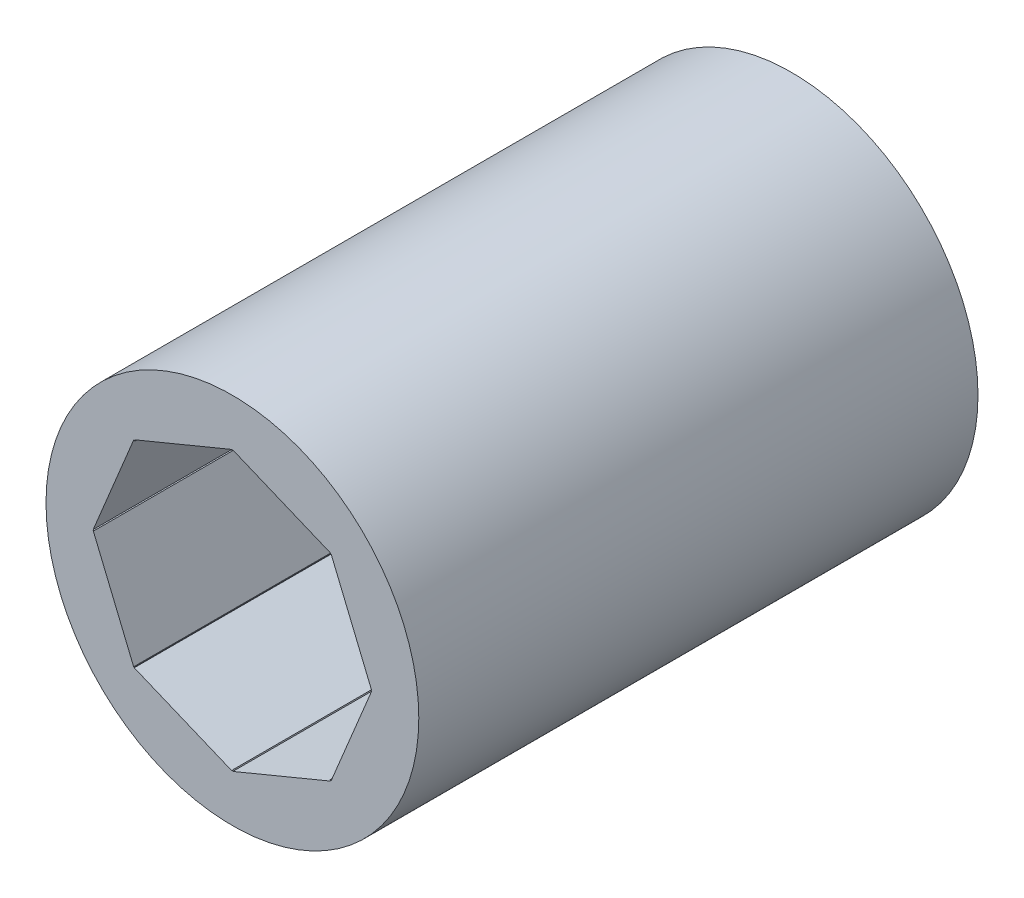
ISO-10303-21;
HEADER;
FILE_DESCRIPTION(('STEP AP214'),'2;1');
FILE_NAME('part.step','',(''),(''),'','','');
FILE_SCHEMA(('AUTOMOTIVE_DESIGN { 1 0 10303 214 1 1 1 1 }'));
ENDSEC;
DATA;
#1=APPLICATION_CONTEXT('core data for automotive mechanical design processes');
#2=APPLICATION_PROTOCOL_DEFINITION('international standard','automotive_design',2000,#1);
#3=PRODUCT_CONTEXT('',#1,'mechanical');
#4=PRODUCT('Part','Part','',(#3));
#5=PRODUCT_RELATED_PRODUCT_CATEGORY('part','',(#4));
#6=PRODUCT_DEFINITION_FORMATION('','',#4);
#7=PRODUCT_DEFINITION_CONTEXT('part definition',#1,'design');
#8=PRODUCT_DEFINITION('design','',#6,#7);
#9=PRODUCT_DEFINITION_SHAPE('','',#8);
#10=(LENGTH_UNIT() NAMED_UNIT(*) SI_UNIT(.MILLI.,.METRE.));
#11=(NAMED_UNIT(*) PLANE_ANGLE_UNIT() SI_UNIT($,.RADIAN.));
#12=(NAMED_UNIT(*) SI_UNIT($,.STERADIAN.) SOLID_ANGLE_UNIT());
#13=UNCERTAINTY_MEASURE_WITH_UNIT(LENGTH_MEASURE(1.E-05),#10,'distance_accuracy_value','');
#14=(GEOMETRIC_REPRESENTATION_CONTEXT(3) GLOBAL_UNCERTAINTY_ASSIGNED_CONTEXT((#13)) GLOBAL_UNIT_ASSIGNED_CONTEXT((#10,
#11,#12)) REPRESENTATION_CONTEXT('',''));
#15=CARTESIAN_POINT('',(0.,0.,0.));
#16=DIRECTION('',(0.,0.,1.));
#17=DIRECTION('',(1.,0.,0.));
#18=AXIS2_PLACEMENT_3D('',#15,#16,#17);
#19=CARTESIAN_POINT('',(0.,0.,-30.));
#20=DIRECTION('',(0.,0.,1.));
#21=DIRECTION('',(1.,0.,0.));
#22=AXIS2_PLACEMENT_3D('',#19,#20,#21);
#23=CYLINDRICAL_SURFACE('',#22,5.);
#24=DIRECTION('',(0.,0.,1.));
#25=VECTOR('',#24,1.);
#26=CARTESIAN_POINT('',(4.89897948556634,1.00000000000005,-30.));
#27=LINE('',#26,#25);
#28=CARTESIAN_POINT('',(4.89897948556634,1.00000000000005,-30.));
#29=VERTEX_POINT('',#28);
#30=CARTESIAN_POINT('',(4.89897948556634,1.00000000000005,-18.7881754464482));
#31=VERTEX_POINT('',#30);
#32=EDGE_CURVE('E822',#29,#31,#27,.T.);
#33=ORIENTED_EDGE('',*,*,#32,.T.);
#34=CARTESIAN_POINT('',(0.,0.,-17.8372966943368));
#35=DIRECTION('',(-0.270598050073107,0.653281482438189,-0.707106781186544));
#36=DIRECTION('',(-0.270598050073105,0.653281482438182,0.707106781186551));
#37=AXIS2_PLACEMENT_3D('',#34,#35,#36);
#38=ELLIPSE('',#37,7.07106781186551,5.);
#39=CARTESIAN_POINT('',(4.17120839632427,2.75699483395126,-16.8864179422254));
#40=VERTEX_POINT('',#39);
#41=EDGE_CURVE('E673',#31,#40,#38,.F.);
#42=ORIENTED_EDGE('',*,*,#41,.T.);
#43=DIRECTION('',(0.,0.,1.));
#44=VECTOR('',#43,1.);
#45=CARTESIAN_POINT('',(4.17120839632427,2.75699483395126,-30.));
#46=LINE('',#45,#44);
#47=CARTESIAN_POINT('',(4.17120839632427,2.75699483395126,-30.));
#48=VERTEX_POINT('',#47);
#49=EDGE_CURVE('E793',#48,#40,#46,.T.);
#50=ORIENTED_EDGE('',*,*,#49,.F.);
#51=CARTESIAN_POINT('',(0.,0.,-30.));
#52=DIRECTION('',(0.,0.,1.));
#53=DIRECTION('',(1.,0.,0.));
#54=AXIS2_PLACEMENT_3D('',#51,#52,#53);
#55=CIRCLE('',#54,5.);
#56=EDGE_CURVE('E979',#29,#48,#55,.T.);
#57=ORIENTED_EDGE('',*,*,#56,.F.);
#58=EDGE_LOOP('',(#33,#42,#50,#57));
#59=FACE_BOUND('',#58,.T.);
#60=ADVANCED_FACE('F35',(#59),#23,.F.);
#61=DIRECTION('',(0.,0.,1.));
#62=VECTOR('',#61,1.);
#63=CARTESIAN_POINT('',(4.17120839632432,-2.75699483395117,-30.));
#64=LINE('',#63,#62);
#65=CARTESIAN_POINT('',(4.17120839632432,-2.75699483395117,-30.));
#66=VERTEX_POINT('',#65);
#67=CARTESIAN_POINT('',(4.17120839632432,-2.75699483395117,-18.7881754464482));
#68=VERTEX_POINT('',#67);
#69=EDGE_CURVE('E842',#66,#68,#64,.T.);
#70=ORIENTED_EDGE('',*,*,#69,.T.);
#71=CARTESIAN_POINT('',(0.,0.,-17.8372966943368));
#72=DIRECTION('',(0.270598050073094,0.653281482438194,-0.707106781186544));
#73=DIRECTION('',(0.270598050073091,0.653281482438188,0.707106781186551));
#74=AXIS2_PLACEMENT_3D('',#71,#72,#73);
#75=ELLIPSE('',#74,7.07106781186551,5.);
#76=CARTESIAN_POINT('',(4.89897948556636,-0.99999999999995,-16.8864179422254));
#77=VERTEX_POINT('',#76);
#78=EDGE_CURVE('E727',#68,#77,#75,.F.);
#79=ORIENTED_EDGE('',*,*,#78,.T.);
#80=DIRECTION('',(0.,0.,1.));
#81=VECTOR('',#80,1.);
#82=CARTESIAN_POINT('',(4.89897948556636,-0.999999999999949,-30.));
#83=LINE('',#82,#81);
#84=CARTESIAN_POINT('',(4.89897948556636,-0.999999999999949,-30.));
#85=VERTEX_POINT('',#84);
#86=EDGE_CURVE('E813',#85,#77,#83,.T.);
#87=ORIENTED_EDGE('',*,*,#86,.F.);
#88=EDGE_CURVE('E975',#66,#85,#55,.T.);
#89=ORIENTED_EDGE('',*,*,#88,.F.);
#90=EDGE_LOOP('',(#70,#79,#87,#89));
#91=FACE_BOUND('',#90,.T.);
#92=ADVANCED_FACE('F965',(#91),#23,.F.);
#93=DIRECTION('',(0.,0.,1.));
#94=VECTOR('',#93,1.);
#95=CARTESIAN_POINT('',(1.00000000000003,-4.89897948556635,-30.));
#96=LINE('',#95,#94);
#97=CARTESIAN_POINT('',(1.00000000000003,-4.89897948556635,-30.));
#98=VERTEX_POINT('',#97);
#99=CARTESIAN_POINT('',(1.00000000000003,-4.89897948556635,-18.7881754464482));
#100=VERTEX_POINT('',#99);
#101=EDGE_CURVE('E862',#98,#100,#96,.T.);
#102=ORIENTED_EDGE('',*,*,#101,.T.);
#103=CARTESIAN_POINT('',(0.,0.,-17.8372966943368));
#104=DIRECTION('',(0.65328148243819,0.270598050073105,-0.707106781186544));
#105=DIRECTION('',(0.653281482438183,0.270598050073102,0.707106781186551));
#106=AXIS2_PLACEMENT_3D('',#103,#104,#105);
#107=ELLIPSE('',#106,7.07106781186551,5.);
#108=CARTESIAN_POINT('',(2.75699483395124,-4.17120839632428,-16.8864179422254));
#109=VERTEX_POINT('',#108);
#110=EDGE_CURVE('E705',#100,#109,#107,.F.);
#111=ORIENTED_EDGE('',*,*,#110,.T.);
#112=DIRECTION('',(0.,0.,1.));
#113=VECTOR('',#112,1.);
#114=CARTESIAN_POINT('',(2.75699483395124,-4.17120839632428,-30.));
#115=LINE('',#114,#113);
#116=CARTESIAN_POINT('',(2.75699483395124,-4.17120839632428,-30.));
#117=VERTEX_POINT('',#116);
#118=EDGE_CURVE('E833',#117,#109,#115,.T.);
#119=ORIENTED_EDGE('',*,*,#118,.F.);
#120=EDGE_CURVE('E978',#98,#117,#55,.T.);
#121=ORIENTED_EDGE('',*,*,#120,.F.);
#122=EDGE_LOOP('',(#102,#111,#119,#121));
#123=FACE_BOUND('',#122,.T.);
#124=ADVANCED_FACE('F1135',(#123),#23,.F.);
#125=DIRECTION('',(0.,0.,1.));
#126=VECTOR('',#125,1.);
#127=CARTESIAN_POINT('',(-2.75699483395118,-4.17120839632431,-30.));
#128=LINE('',#127,#126);
#129=CARTESIAN_POINT('',(-2.75699483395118,-4.17120839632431,-30.));
#130=VERTEX_POINT('',#129);
#131=CARTESIAN_POINT('',(-2.75699483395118,-4.17120839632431,-18.7881754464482));
#132=VERTEX_POINT('',#131);
#133=EDGE_CURVE('E882',#130,#132,#128,.T.);
#134=ORIENTED_EDGE('',*,*,#133,.T.);
#135=CARTESIAN_POINT('',(0.,0.,-17.8372966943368));
#136=DIRECTION('',(0.653281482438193,-0.270598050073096,-0.707106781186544));
#137=DIRECTION('',(0.653281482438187,-0.270598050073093,0.707106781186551));
#138=AXIS2_PLACEMENT_3D('',#135,#136,#137);
#139=ELLIPSE('',#138,7.07106781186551,5.);
#140=CARTESIAN_POINT('',(-0.999999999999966,-4.89897948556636,-16.8864179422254));
#141=VERTEX_POINT('',#140);
#142=EDGE_CURVE('E737',#132,#141,#139,.F.);
#143=ORIENTED_EDGE('',*,*,#142,.T.);
#144=DIRECTION('',(0.,0.,1.));
#145=VECTOR('',#144,1.);
#146=CARTESIAN_POINT('',(-0.999999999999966,-4.89897948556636,-30.));
#147=LINE('',#146,#145);
#148=CARTESIAN_POINT('',(-0.999999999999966,-4.89897948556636,-30.));
#149=VERTEX_POINT('',#148);
#150=EDGE_CURVE('E853',#149,#141,#147,.T.);
#151=ORIENTED_EDGE('',*,*,#150,.F.);
#152=EDGE_CURVE('E981',#130,#149,#55,.T.);
#153=ORIENTED_EDGE('',*,*,#152,.F.);
#154=EDGE_LOOP('',(#134,#143,#151,#153));
#155=FACE_BOUND('',#154,.T.);
#156=ADVANCED_FACE('F1121',(#155),#23,.F.);
#157=DIRECTION('',(0.,0.,1.));
#158=VECTOR('',#157,1.);
#159=CARTESIAN_POINT('',(-4.89897948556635,-1.00000000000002,-30.));
#160=LINE('',#159,#158);
#161=CARTESIAN_POINT('',(-4.89897948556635,-1.00000000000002,-30.));
#162=VERTEX_POINT('',#161);
#163=CARTESIAN_POINT('',(-4.89897948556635,-1.00000000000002,-18.7881754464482));
#164=VERTEX_POINT('',#163);
#165=EDGE_CURVE('E902',#162,#164,#160,.T.);
#166=ORIENTED_EDGE('',*,*,#165,.T.);
#167=CARTESIAN_POINT('',(0.,0.,-17.8372966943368));
#168=DIRECTION('',(0.270598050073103,-0.653281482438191,-0.707106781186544));
#169=DIRECTION('',(0.2705980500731,-0.653281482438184,0.707106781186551));
#170=AXIS2_PLACEMENT_3D('',#167,#168,#169);
#171=ELLIPSE('',#170,7.07106781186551,5.);
#172=CARTESIAN_POINT('',(-4.17120839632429,-2.75699483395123,-16.8864179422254));
#173=VERTEX_POINT('',#172);
#174=EDGE_CURVE('E691',#164,#173,#171,.F.);
#175=ORIENTED_EDGE('',*,*,#174,.T.);
#176=DIRECTION('',(0.,0.,1.));
#177=VECTOR('',#176,1.);
#178=CARTESIAN_POINT('',(-4.17120839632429,-2.75699483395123,-30.));
#179=LINE('',#178,#177);
#180=CARTESIAN_POINT('',(-4.17120839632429,-2.75699483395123,-30.));
#181=VERTEX_POINT('',#180);
#182=EDGE_CURVE('E873',#181,#173,#179,.T.);
#183=ORIENTED_EDGE('',*,*,#182,.F.);
#184=EDGE_CURVE('E1109',#162,#181,#55,.T.);
#185=ORIENTED_EDGE('',*,*,#184,.F.);
#186=EDGE_LOOP('',(#166,#175,#183,#185));
#187=FACE_BOUND('',#186,.T.);
#188=ADVANCED_FACE('F1185',(#187),#23,.F.);
#189=DIRECTION('',(0.,0.,1.));
#190=VECTOR('',#189,1.);
#191=CARTESIAN_POINT('',(-4.1712083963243,2.7569948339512,-30.));
#192=LINE('',#191,#190);
#193=CARTESIAN_POINT('',(-4.1712083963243,2.7569948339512,-30.));
#194=VERTEX_POINT('',#193);
#195=CARTESIAN_POINT('',(-4.17120839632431,2.7569948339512,-18.7881754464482));
#196=VERTEX_POINT('',#195);
#197=EDGE_CURVE('E922',#194,#196,#192,.T.);
#198=ORIENTED_EDGE('',*,*,#197,.T.);
#199=CARTESIAN_POINT('',(0.,0.,-17.8372966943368));
#200=DIRECTION('',(-0.270598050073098,-0.653281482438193,-0.707106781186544));
#201=DIRECTION('',(-0.270598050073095,-0.653281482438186,0.707106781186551));
#202=AXIS2_PLACEMENT_3D('',#199,#200,#201);
#203=ELLIPSE('',#202,7.07106781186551,5.);
#204=CARTESIAN_POINT('',(-4.89897948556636,0.999999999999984,-16.8864179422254));
#205=VERTEX_POINT('',#204);
#206=EDGE_CURVE('E775',#196,#205,#203,.F.);
#207=ORIENTED_EDGE('',*,*,#206,.T.);
#208=DIRECTION('',(0.,0.,1.));
#209=VECTOR('',#208,1.);
#210=CARTESIAN_POINT('',(-4.89897948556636,0.999999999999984,-30.));
#211=LINE('',#210,#209);
#212=CARTESIAN_POINT('',(-4.89897948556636,0.999999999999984,-30.));
#213=VERTEX_POINT('',#212);
#214=EDGE_CURVE('E893',#213,#205,#211,.T.);
#215=ORIENTED_EDGE('',*,*,#214,.F.);
#216=EDGE_CURVE('E948',#194,#213,#55,.T.);
#217=ORIENTED_EDGE('',*,*,#216,.F.);
#218=EDGE_LOOP('',(#198,#207,#215,#217));
#219=FACE_BOUND('',#218,.T.);
#220=ADVANCED_FACE('F1106',(#219),#23,.F.);
#221=DIRECTION('',(0.,0.,1.));
#222=VECTOR('',#221,1.);
#223=CARTESIAN_POINT('',(-1.,4.89897948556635,-30.));
#224=LINE('',#223,#222);
#225=CARTESIAN_POINT('',(-1.,4.89897948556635,-30.));
#226=VERTEX_POINT('',#225);
#227=CARTESIAN_POINT('',(-1.,4.89897948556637,-18.7881754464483));
#228=VERTEX_POINT('',#227);
#229=EDGE_CURVE('E50',#226,#228,#224,.T.);
#230=ORIENTED_EDGE('',*,*,#229,.T.);
#231=CARTESIAN_POINT('',(0.,0.,-17.8372966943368));
#232=DIRECTION('',(-0.653281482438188,-0.27059805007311,-0.707106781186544));
#233=DIRECTION('',(-0.653281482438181,-0.270598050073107,0.707106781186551));
#234=AXIS2_PLACEMENT_3D('',#231,#232,#233);
#235=ELLIPSE('',#234,7.07106781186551,5.);
#236=CARTESIAN_POINT('',(-2.7569948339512,4.17120839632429,-16.8864179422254));
#237=VERTEX_POINT('',#236);
#238=EDGE_CURVE('E655',#228,#237,#235,.F.);
#239=ORIENTED_EDGE('',*,*,#238,.T.);
#240=DIRECTION('',(0.,0.,1.));
#241=VECTOR('',#240,1.);
#242=CARTESIAN_POINT('',(-2.75699483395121,4.1712083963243,-30.));
#243=LINE('',#242,#241);
#244=CARTESIAN_POINT('',(-2.75699483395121,4.1712083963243,-30.));
#245=VERTEX_POINT('',#244);
#246=EDGE_CURVE('E913',#245,#237,#243,.T.);
#247=ORIENTED_EDGE('',*,*,#246,.F.);
#248=EDGE_CURVE('E944',#226,#245,#55,.T.);
#249=ORIENTED_EDGE('',*,*,#248,.F.);
#250=EDGE_LOOP('',(#230,#239,#247,#249));
#251=FACE_BOUND('',#250,.T.);
#252=ADVANCED_FACE('F1091',(#251),#23,.F.);
#253=DIRECTION('',(0.,0.,1.));
#254=VECTOR('',#253,1.);
#255=CARTESIAN_POINT('',(2.75699483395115,4.17120839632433,-30.));
#256=LINE('',#255,#254);
#257=CARTESIAN_POINT('',(2.75699483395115,4.17120839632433,-30.));
#258=VERTEX_POINT('',#257);
#259=CARTESIAN_POINT('',(2.75699483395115,4.17120839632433,-18.7881754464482));
#260=VERTEX_POINT('',#259);
#261=EDGE_CURVE('E802',#258,#260,#256,.T.);
#262=ORIENTED_EDGE('',*,*,#261,.T.);
#263=CARTESIAN_POINT('',(0.,0.,-17.8372966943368));
#264=DIRECTION('',(-0.653281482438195,0.270598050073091,-0.707106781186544));
#265=DIRECTION('',(-0.653281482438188,0.270598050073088,0.707106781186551));
#266=AXIS2_PLACEMENT_3D('',#263,#264,#265);
#267=ELLIPSE('',#266,7.07106781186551,5.);
#268=CARTESIAN_POINT('',(1.,4.89897948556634,-16.8864179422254));
#269=VERTEX_POINT('',#268);
#270=EDGE_CURVE('E718',#260,#269,#267,.F.);
#271=ORIENTED_EDGE('',*,*,#270,.T.);
#272=DIRECTION('',(0.,0.,1.));
#273=VECTOR('',#272,1.);
#274=CARTESIAN_POINT('',(1.,4.89897948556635,-30.));
#275=LINE('',#274,#273);
#276=CARTESIAN_POINT('',(1.,4.89897948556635,-30.));
#277=VERTEX_POINT('',#276);
#278=EDGE_CURVE('E935',#277,#269,#275,.T.);
#279=ORIENTED_EDGE('',*,*,#278,.F.);
#280=EDGE_CURVE('E949',#258,#277,#55,.T.);
#281=ORIENTED_EDGE('',*,*,#280,.F.);
#282=EDGE_LOOP('',(#262,#271,#279,#281));
#283=FACE_BOUND('',#282,.T.);
#284=ADVANCED_FACE('F37',(#283),#23,.F.);
#285=CARTESIAN_POINT('',(0.,0.,-30.));
#286=DIRECTION('',(0.,0.,1.));
#287=DIRECTION('',(1.,0.,0.));
#288=AXIS2_PLACEMENT_3D('',#285,#286,#287);
#289=CYLINDRICAL_SURFACE('',#288,9.99999999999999);
#290=CARTESIAN_POINT('',(0.,0.,-30.));
#291=DIRECTION('',(0.,0.,1.));
#292=DIRECTION('',(1.,0.,0.));
#293=AXIS2_PLACEMENT_3D('',#290,#291,#292);
#294=CIRCLE('',#293,9.99999999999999);
#295=CARTESIAN_POINT('',(9.99999999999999,0.,-30.));
#296=VERTEX_POINT('',#295);
#297=EDGE_CURVE('E947',#296,#296,#294,.T.);
#298=ORIENTED_EDGE('',*,*,#297,.T.);
#299=EDGE_LOOP('',(#298));
#300=FACE_BOUND('',#299,.T.);
#301=CARTESIAN_POINT('',(0.,0.,0.));
#302=DIRECTION('',(0.,0.,1.));
#303=DIRECTION('',(1.,0.,0.));
#304=AXIS2_PLACEMENT_3D('',#301,#302,#303);
#305=CIRCLE('',#304,9.99999999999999);
#306=CARTESIAN_POINT('',(9.99999999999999,0.,0.));
#307=VERTEX_POINT('',#306);
#308=EDGE_CURVE('E937',#307,#307,#305,.T.);
#309=ORIENTED_EDGE('',*,*,#308,.F.);
#310=EDGE_LOOP('',(#309));
#311=FACE_BOUND('',#310,.T.);
#312=ADVANCED_FACE('F1176',(#300,#311),#289,.T.);
#313=CARTESIAN_POINT('',(0.,-22.1414213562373,-30.));
#314=DIRECTION('',(0.,0.,1.));
#315=DIRECTION('',(1.,0.,0.));
#316=AXIS2_PLACEMENT_3D('',#313,#314,#315);
#317=PLANE('',#316);
#318=DIRECTION('',(0.707106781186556,-0.707106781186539,0.));
#319=VECTOR('',#318,1.);
#320=CARTESIAN_POINT('',(4.94974746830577,4.94974746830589,-30.));
#321=LINE('',#320,#319);
#322=CARTESIAN_POINT('',(4.24264068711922,5.65685424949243,-30.));
#323=VERTEX_POINT('',#322);
#324=CARTESIAN_POINT('',(5.65685424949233,4.24264068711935,-30.));
#325=VERTEX_POINT('',#324);
#326=EDGE_CURVE('E799',#323,#325,#321,.T.);
#327=ORIENTED_EDGE('',*,*,#326,.F.);
#328=DIRECTION('',(-0.707106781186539,-0.707106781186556,0.));
#329=VECTOR('',#328,1.);
#330=CARTESIAN_POINT('',(-16.3634559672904,-14.9492424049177,-30.));
#331=LINE('',#330,#329);
#332=EDGE_CURVE('E805',#323,#258,#331,.T.);
#333=ORIENTED_EDGE('',*,*,#332,.T.);
#334=ORIENTED_EDGE('',*,*,#280,.T.);
#335=DIRECTION('',(0.,-1.,0.));
#336=VECTOR('',#335,1.);
#337=CARTESIAN_POINT('',(1.,-22.1414213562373,-30.));
#338=LINE('',#337,#336);
#339=CARTESIAN_POINT('',(1.,7.,-30.));
#340=VERTEX_POINT('',#339);
#341=EDGE_CURVE('E928',#340,#277,#338,.T.);
#342=ORIENTED_EDGE('',*,*,#341,.F.);
#343=DIRECTION('',(1.,0.,0.));
#344=VECTOR('',#343,1.);
#345=CARTESIAN_POINT('',(0.,7.,-30.));
#346=LINE('',#345,#344);
#347=CARTESIAN_POINT('',(-1.,7.,-30.));
#348=VERTEX_POINT('',#347);
#349=EDGE_CURVE('E931',#348,#340,#346,.T.);
#350=ORIENTED_EDGE('',*,*,#349,.F.);
#351=DIRECTION('',(0.,-1.,0.));
#352=VECTOR('',#351,1.);
#353=CARTESIAN_POINT('',(-0.999999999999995,-22.1414213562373,-30.));
#354=LINE('',#353,#352);
#355=EDGE_CURVE('E933',#348,#226,#354,.T.);
#356=ORIENTED_EDGE('',*,*,#355,.T.);
#357=ORIENTED_EDGE('',*,*,#248,.T.);
#358=DIRECTION('',(0.707106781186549,-0.707106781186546,0.));
#359=VECTOR('',#358,1.);
#360=CARTESIAN_POINT('',(16.3634559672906,-14.9492424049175,-30.));
#361=LINE('',#360,#359);
#362=CARTESIAN_POINT('',(-4.2426406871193,5.65685424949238,-30.));
#363=VERTEX_POINT('',#362);
#364=EDGE_CURVE('E911',#363,#245,#361,.T.);
#365=ORIENTED_EDGE('',*,*,#364,.F.);
#366=DIRECTION('',(0.707106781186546,0.707106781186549,0.));
#367=VECTOR('',#366,1.);
#368=CARTESIAN_POINT('',(-4.94974746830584,4.94974746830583,-30.));
#369=LINE('',#368,#367);
#370=CARTESIAN_POINT('',(-5.65685424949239,4.24264068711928,-30.));
#371=VERTEX_POINT('',#370);
#372=EDGE_CURVE('E919',#371,#363,#369,.T.);
#373=ORIENTED_EDGE('',*,*,#372,.F.);
#374=DIRECTION('',(0.707106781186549,-0.707106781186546,0.));
#375=VECTOR('',#374,1.);
#376=CARTESIAN_POINT('',(14.9492424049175,-16.3634559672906,-30.));
#377=LINE('',#376,#375);
#378=EDGE_CURVE('E925',#371,#194,#377,.T.);
#379=ORIENTED_EDGE('',*,*,#378,.T.);
#380=ORIENTED_EDGE('',*,*,#216,.T.);
#381=DIRECTION('',(1.,0.,0.));
#382=VECTOR('',#381,1.);
#383=CARTESIAN_POINT('',(22.1414213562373,1.00000000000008,-30.));
#384=LINE('',#383,#382);
#385=CARTESIAN_POINT('',(-7.00000000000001,0.999999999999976,-30.));
#386=VERTEX_POINT('',#385);
#387=EDGE_CURVE('E891',#386,#213,#384,.T.);
#388=ORIENTED_EDGE('',*,*,#387,.F.);
#389=DIRECTION('',(0.,1.,0.));
#390=VECTOR('',#389,1.);
#391=CARTESIAN_POINT('',(-7.,0.,-30.));
#392=LINE('',#391,#390);
#393=CARTESIAN_POINT('',(-7.,-1.00000000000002,-30.));
#394=VERTEX_POINT('',#393);
#395=EDGE_CURVE('E899',#394,#386,#392,.T.);
#396=ORIENTED_EDGE('',*,*,#395,.F.);
#397=DIRECTION('',(1.,0.,0.));
#398=VECTOR('',#397,1.);
#399=CARTESIAN_POINT('',(22.1414213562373,-0.999999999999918,-30.));
#400=LINE('',#399,#398);
#401=EDGE_CURVE('E905',#394,#162,#400,.T.);
#402=ORIENTED_EDGE('',*,*,#401,.T.);
#403=ORIENTED_EDGE('',*,*,#184,.T.);
#404=DIRECTION('',(0.707106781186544,0.707106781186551,0.));
#405=VECTOR('',#404,1.);
#406=CARTESIAN_POINT('',(14.9492424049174,16.3634559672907,-30.));
#407=LINE('',#406,#405);
#408=CARTESIAN_POINT('',(-5.65685424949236,-4.24264068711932,-30.));
#409=VERTEX_POINT('',#408);
#410=EDGE_CURVE('E871',#409,#181,#407,.T.);
#411=ORIENTED_EDGE('',*,*,#410,.F.);
#412=DIRECTION('',(-0.707106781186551,0.707106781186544,0.));
#413=VECTOR('',#412,1.);
#414=CARTESIAN_POINT('',(-4.94974746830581,-4.94974746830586,-30.));
#415=LINE('',#414,#413);
#416=CARTESIAN_POINT('',(-4.24264068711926,-5.6568542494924,-30.));
#417=VERTEX_POINT('',#416);
#418=EDGE_CURVE('E879',#417,#409,#415,.T.);
#419=ORIENTED_EDGE('',*,*,#418,.F.);
#420=DIRECTION('',(0.707106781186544,0.707106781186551,0.));
#421=VECTOR('',#420,1.);
#422=CARTESIAN_POINT('',(16.3634559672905,14.9492424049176,-30.));
#423=LINE('',#422,#421);
#424=EDGE_CURVE('E885',#417,#130,#423,.T.);
#425=ORIENTED_EDGE('',*,*,#424,.T.);
#426=ORIENTED_EDGE('',*,*,#152,.T.);
#427=DIRECTION('',(0.,1.,0.));
#428=VECTOR('',#427,1.);
#429=CARTESIAN_POINT('',(-1.00000000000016,22.1414213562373,-30.));
#430=LINE('',#429,#428);
#431=CARTESIAN_POINT('',(-0.999999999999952,-7.00000000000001,-30.));
#432=VERTEX_POINT('',#431);
#433=EDGE_CURVE('E851',#432,#149,#430,.T.);
#434=ORIENTED_EDGE('',*,*,#433,.F.);
#435=DIRECTION('',(-1.,0.,0.));
#436=VECTOR('',#435,1.);
#437=CARTESIAN_POINT('',(0.,-7.,-30.));
#438=LINE('',#437,#436);
#439=CARTESIAN_POINT('',(1.00000000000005,-7.,-30.));
#440=VERTEX_POINT('',#439);
#441=EDGE_CURVE('E859',#440,#432,#438,.T.);
#442=ORIENTED_EDGE('',*,*,#441,.F.);
#443=DIRECTION('',(0.,1.,0.));
#444=VECTOR('',#443,1.);
#445=CARTESIAN_POINT('',(0.99999999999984,22.1414213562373,-30.));
#446=LINE('',#445,#444);
#447=EDGE_CURVE('E865',#440,#98,#446,.T.);
#448=ORIENTED_EDGE('',*,*,#447,.T.);
#449=ORIENTED_EDGE('',*,*,#120,.T.);
#450=DIRECTION('',(-0.707106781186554,0.707106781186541,0.));
#451=VECTOR('',#450,1.);
#452=CARTESIAN_POINT('',(-16.3634559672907,14.9492424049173,-30.));
#453=LINE('',#452,#451);
#454=CARTESIAN_POINT('',(4.24264068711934,-5.65685424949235,-30.));
#455=VERTEX_POINT('',#454);
#456=EDGE_CURVE('E831',#455,#117,#453,.T.);
#457=ORIENTED_EDGE('',*,*,#456,.F.);
#458=DIRECTION('',(-0.707106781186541,-0.707106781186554,0.));
#459=VECTOR('',#458,1.);
#460=CARTESIAN_POINT('',(4.94974746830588,-4.94974746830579,-30.));
#461=LINE('',#460,#459);
#462=CARTESIAN_POINT('',(5.65685424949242,-4.24264068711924,-30.));
#463=VERTEX_POINT('',#462);
#464=EDGE_CURVE('E839',#463,#455,#461,.T.);
#465=ORIENTED_EDGE('',*,*,#464,.F.);
#466=DIRECTION('',(-0.707106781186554,0.707106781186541,0.));
#467=VECTOR('',#466,1.);
#468=CARTESIAN_POINT('',(-14.9492424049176,16.3634559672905,-30.));
#469=LINE('',#468,#467);
#470=EDGE_CURVE('E845',#463,#66,#469,.T.);
#471=ORIENTED_EDGE('',*,*,#470,.T.);
#472=ORIENTED_EDGE('',*,*,#88,.T.);
#473=DIRECTION('',(-1.,0.,0.));
#474=VECTOR('',#473,1.);
#475=CARTESIAN_POINT('',(-22.1414213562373,-1.00000000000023,-30.));
#476=LINE('',#475,#474);
#477=CARTESIAN_POINT('',(7.00000000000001,-0.999999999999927,-30.));
#478=VERTEX_POINT('',#477);
#479=EDGE_CURVE('E811',#478,#85,#476,.T.);
#480=ORIENTED_EDGE('',*,*,#479,.F.);
#481=DIRECTION('',(0.,-1.,0.));
#482=VECTOR('',#481,1.);
#483=CARTESIAN_POINT('',(7.,0.,-30.));
#484=LINE('',#483,#482);
#485=CARTESIAN_POINT('',(6.99999999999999,1.00000000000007,-30.));
#486=VERTEX_POINT('',#485);
#487=EDGE_CURVE('E819',#486,#478,#484,.T.);
#488=ORIENTED_EDGE('',*,*,#487,.F.);
#489=DIRECTION('',(-1.,0.,0.));
#490=VECTOR('',#489,1.);
#491=CARTESIAN_POINT('',(-22.1414213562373,0.999999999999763,-30.));
#492=LINE('',#491,#490);
#493=EDGE_CURVE('E825',#486,#29,#492,.T.);
#494=ORIENTED_EDGE('',*,*,#493,.T.);
#495=ORIENTED_EDGE('',*,*,#56,.T.);
#496=DIRECTION('',(-0.707106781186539,-0.707106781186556,0.));
#497=VECTOR('',#496,1.);
#498=CARTESIAN_POINT('',(-14.9492424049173,-16.3634559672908,-30.));
#499=LINE('',#498,#497);
#500=EDGE_CURVE('E791',#325,#48,#499,.T.);
#501=ORIENTED_EDGE('',*,*,#500,.F.);
#502=EDGE_LOOP('',(#327,#333,#334,#342,#350,#356,#357,#365,#373,#379,#380,#388,#396,#402,#403,
#411,#419,#425,#426,#434,#442,#448,#449,#457,#465,#471,#472,#480,#488,#494,#495,#501));
#503=FACE_BOUND('',#502,.T.);
#504=ORIENTED_EDGE('',*,*,#297,.F.);
#505=EDGE_LOOP('',(#504));
#506=FACE_BOUND('',#505,.T.);
#507=ADVANCED_FACE('F973',(#503,#506),#317,.F.);
#508=CARTESIAN_POINT('',(0.,-22.1414213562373,0.));
#509=DIRECTION('',(0.,0.,1.));
#510=DIRECTION('',(1.,0.,0.));
#511=AXIS2_PLACEMENT_3D('',#508,#509,#510);
#512=PLANE('',#511);
#513=DIRECTION('',(0.923879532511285,0.382683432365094,0.));
#514=VECTOR('',#513,1.);
#515=CARTESIAN_POINT('',(-7.46863944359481,-0.0225439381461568,0.));
#516=LINE('',#515,#514);
#517=CARTESIAN_POINT('',(-7.46863944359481,-0.0225439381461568,0.));
#518=VERTEX_POINT('',#517);
#519=CARTESIAN_POINT('',(-7.41421356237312,0.,0.));
#520=VERTEX_POINT('',#519);
#521=EDGE_CURVE('E640',#518,#520,#516,.T.);
#522=ORIENTED_EDGE('',*,*,#521,.T.);
#523=DIRECTION('',(0.923879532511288,-0.382683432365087,0.));
#524=VECTOR('',#523,1.);
#525=CARTESIAN_POINT('',(-7.46863944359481,0.0225439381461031,0.));
#526=LINE('',#525,#524);
#527=CARTESIAN_POINT('',(-7.46863944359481,0.0225439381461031,0.));
#528=VERTEX_POINT('',#527);
#529=EDGE_CURVE('E765',#528,#520,#526,.T.);
#530=ORIENTED_EDGE('',*,*,#529,.F.);
#531=DIRECTION('',(-0.382683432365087,-0.923879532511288,0.));
#532=VECTOR('',#531,1.);
#533=CARTESIAN_POINT('',(-7.46863944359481,0.0225439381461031,0.));
#534=LINE('',#533,#532);
#535=CARTESIAN_POINT('',(-5.297066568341,5.26518462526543,0.));
#536=VERTEX_POINT('',#535);
#537=EDGE_CURVE('E748',#536,#528,#534,.T.);
#538=ORIENTED_EDGE('',*,*,#537,.F.);
#539=DIRECTION('',(0.923879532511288,-0.382683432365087,0.));
#540=VECTOR('',#539,1.);
#541=CARTESIAN_POINT('',(-5.297066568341,5.26518462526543,0.));
#542=LINE('',#541,#540);
#543=CARTESIAN_POINT('',(-5.2426406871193,5.24264068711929,0.));
#544=VERTEX_POINT('',#543);
#545=EDGE_CURVE('E757',#536,#544,#542,.T.);
#546=ORIENTED_EDGE('',*,*,#545,.T.);
#547=DIRECTION('',(0.382683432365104,-0.923879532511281,0.));
#548=VECTOR('',#547,1.);
#549=CARTESIAN_POINT('',(-5.26518462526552,5.29706656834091,0.));
#550=LINE('',#549,#548);
#551=CARTESIAN_POINT('',(-5.26518462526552,5.29706656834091,0.));
#552=VERTEX_POINT('',#551);
#553=EDGE_CURVE('E449',#552,#544,#550,.T.);
#554=ORIENTED_EDGE('',*,*,#553,.F.);
#555=DIRECTION('',(-0.923879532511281,-0.382683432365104,0.));
#556=VECTOR('',#555,1.);
#557=CARTESIAN_POINT('',(-5.26518462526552,5.29706656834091,0.));
#558=LINE('',#557,#556);
#559=CARTESIAN_POINT('',(-0.0225439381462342,7.46863944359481,0.));
#560=VERTEX_POINT('',#559);
#561=EDGE_CURVE('E456',#560,#552,#558,.T.);
#562=ORIENTED_EDGE('',*,*,#561,.F.);
#563=DIRECTION('',(0.382683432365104,-0.923879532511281,0.));
#564=VECTOR('',#563,1.);
#565=CARTESIAN_POINT('',(-0.0225439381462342,7.46863944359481,0.));
#566=LINE('',#565,#564);
#567=CARTESIAN_POINT('',(-1.03958047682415E-13,7.41421356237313,0.));
#568=VERTEX_POINT('',#567);
#569=EDGE_CURVE('E437',#560,#568,#566,.T.);
#570=ORIENTED_EDGE('',*,*,#569,.T.);
#571=DIRECTION('',(-0.382683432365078,-0.923879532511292,0.));
#572=VECTOR('',#571,1.);
#573=CARTESIAN_POINT('',(0.0225439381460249,7.46863944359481,0.));
#574=LINE('',#573,#572);
#575=CARTESIAN_POINT('',(0.0225439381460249,7.46863944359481,0.));
#576=VERTEX_POINT('',#575);
#577=EDGE_CURVE('E499',#576,#568,#574,.T.);
#578=ORIENTED_EDGE('',*,*,#577,.F.);
#579=DIRECTION('',(-0.923879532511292,0.382683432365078,0.));
#580=VECTOR('',#579,1.);
#581=CARTESIAN_POINT('',(0.0225439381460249,7.46863944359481,0.));
#582=LINE('',#581,#580);
#583=CARTESIAN_POINT('',(5.26518462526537,5.29706656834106,0.));
#584=VERTEX_POINT('',#583);
#585=EDGE_CURVE('E482',#584,#576,#582,.T.);
#586=ORIENTED_EDGE('',*,*,#585,.F.);
#587=DIRECTION('',(-0.382683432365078,-0.923879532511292,0.));
#588=VECTOR('',#587,1.);
#589=CARTESIAN_POINT('',(5.26518462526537,5.29706656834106,0.));
#590=LINE('',#589,#588);
#591=CARTESIAN_POINT('',(5.24264068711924,5.24264068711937,0.));
#592=VERTEX_POINT('',#591);
#593=EDGE_CURVE('E491',#584,#592,#590,.T.);
#594=ORIENTED_EDGE('',*,*,#593,.T.);
#595=DIRECTION('',(-0.923879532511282,-0.3826834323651,0.));
#596=VECTOR('',#595,1.);
#597=CARTESIAN_POINT('',(5.29706656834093,5.2651846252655,0.));
#598=LINE('',#597,#596);
#599=CARTESIAN_POINT('',(5.29706656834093,5.2651846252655,0.));
#600=VERTEX_POINT('',#599);
#601=EDGE_CURVE('E528',#600,#592,#598,.T.);
#602=ORIENTED_EDGE('',*,*,#601,.F.);
#603=DIRECTION('',(-0.3826834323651,0.923879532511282,0.));
#604=VECTOR('',#603,1.);
#605=CARTESIAN_POINT('',(5.29706656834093,5.2651846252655,0.));
#606=LINE('',#605,#604);
#607=CARTESIAN_POINT('',(7.46863944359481,0.0225439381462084,0.));
#608=VERTEX_POINT('',#607);
#609=EDGE_CURVE('E511',#608,#600,#606,.T.);
#610=ORIENTED_EDGE('',*,*,#609,.F.);
#611=DIRECTION('',(-0.923879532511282,-0.3826834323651,0.));
#612=VECTOR('',#611,1.);
#613=CARTESIAN_POINT('',(7.46863944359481,0.0225439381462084,0.));
#614=LINE('',#613,#612);
#615=CARTESIAN_POINT('',(7.41421356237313,0.,0.));
#616=VERTEX_POINT('',#615);
#617=EDGE_CURVE('E520',#608,#616,#614,.T.);
#618=ORIENTED_EDGE('',*,*,#617,.T.);
#619=DIRECTION('',(-0.923879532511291,0.382683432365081,0.));
#620=VECTOR('',#619,1.);
#621=CARTESIAN_POINT('',(7.46863944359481,-0.0225439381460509,0.));
#622=LINE('',#621,#620);
#623=CARTESIAN_POINT('',(7.46863944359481,-0.0225439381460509,0.));
#624=VERTEX_POINT('',#623);
#625=EDGE_CURVE('E558',#624,#616,#622,.T.);
#626=ORIENTED_EDGE('',*,*,#625,.F.);
#627=DIRECTION('',(0.382683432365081,0.923879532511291,0.));
#628=VECTOR('',#627,1.);
#629=CARTESIAN_POINT('',(7.46863944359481,-0.0225439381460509,0.));
#630=LINE('',#629,#628);
#631=CARTESIAN_POINT('',(5.29706656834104,-5.26518462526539,0.));
#632=VERTEX_POINT('',#631);
#633=EDGE_CURVE('E541',#632,#624,#630,.T.);
#634=ORIENTED_EDGE('',*,*,#633,.F.);
#635=DIRECTION('',(-0.923879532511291,0.382683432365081,0.));
#636=VECTOR('',#635,1.);
#637=CARTESIAN_POINT('',(5.29706656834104,-5.26518462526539,0.));
#638=LINE('',#637,#636);
#639=CARTESIAN_POINT('',(5.24264068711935,-5.24264068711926,0.));
#640=VERTEX_POINT('',#639);
#641=EDGE_CURVE('E550',#632,#640,#638,.T.);
#642=ORIENTED_EDGE('',*,*,#641,.T.);
#643=DIRECTION('',(-0.382683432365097,0.923879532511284,0.));
#644=VECTOR('',#643,1.);
#645=CARTESIAN_POINT('',(5.26518462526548,-5.29706656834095,0.));
#646=LINE('',#645,#644);
#647=CARTESIAN_POINT('',(5.26518462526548,-5.29706656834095,0.));
#648=VERTEX_POINT('',#647);
#649=EDGE_CURVE('E588',#648,#640,#646,.T.);
#650=ORIENTED_EDGE('',*,*,#649,.F.);
#651=DIRECTION('',(0.923879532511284,0.382683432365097,0.));
#652=VECTOR('',#651,1.);
#653=CARTESIAN_POINT('',(5.26518462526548,-5.29706656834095,0.));
#654=LINE('',#653,#652);
#655=CARTESIAN_POINT('',(0.0225439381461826,-7.46863944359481,0.));
#656=VERTEX_POINT('',#655);
#657=EDGE_CURVE('E571',#656,#648,#654,.T.);
#658=ORIENTED_EDGE('',*,*,#657,.F.);
#659=DIRECTION('',(-0.382683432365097,0.923879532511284,0.));
#660=VECTOR('',#659,1.);
#661=CARTESIAN_POINT('',(0.0225439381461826,-7.46863944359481,0.));
#662=LINE('',#661,#660);
#663=CARTESIAN_POINT('',(0.,-7.41421356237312,0.));
#664=VERTEX_POINT('',#663);
#665=EDGE_CURVE('E580',#656,#664,#662,.T.);
#666=ORIENTED_EDGE('',*,*,#665,.T.);
#667=DIRECTION('',(0.382683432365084,0.923879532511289,0.));
#668=VECTOR('',#667,1.);
#669=CARTESIAN_POINT('',(-0.0225439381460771,-7.46863944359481,0.));
#670=LINE('',#669,#668);
#671=CARTESIAN_POINT('',(-0.0225439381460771,-7.46863944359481,0.));
#672=VERTEX_POINT('',#671);
#673=EDGE_CURVE('E618',#672,#664,#670,.T.);
#674=ORIENTED_EDGE('',*,*,#673,.F.);
#675=DIRECTION('',(0.923879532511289,-0.382683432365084,0.));
#676=VECTOR('',#675,1.);
#677=CARTESIAN_POINT('',(-0.0225439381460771,-7.46863944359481,0.));
#678=LINE('',#677,#676);
#679=CARTESIAN_POINT('',(-5.26518462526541,-5.29706656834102,0.));
#680=VERTEX_POINT('',#679);
#681=EDGE_CURVE('E601',#680,#672,#678,.T.);
#682=ORIENTED_EDGE('',*,*,#681,.F.);
#683=DIRECTION('',(0.382683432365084,0.923879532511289,0.));
#684=VECTOR('',#683,1.);
#685=CARTESIAN_POINT('',(-5.26518462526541,-5.29706656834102,0.));
#686=LINE('',#685,#684);
#687=CARTESIAN_POINT('',(-5.24264068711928,-5.24264068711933,0.));
#688=VERTEX_POINT('',#687);
#689=EDGE_CURVE('E610',#680,#688,#686,.T.);
#690=ORIENTED_EDGE('',*,*,#689,.T.);
#691=DIRECTION('',(0.923879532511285,0.382683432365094,0.));
#692=VECTOR('',#691,1.);
#693=CARTESIAN_POINT('',(-5.29706656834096,-5.26518462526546,0.));
#694=LINE('',#693,#692);
#695=CARTESIAN_POINT('',(-5.29706656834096,-5.26518462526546,0.));
#696=VERTEX_POINT('',#695);
#697=EDGE_CURVE('E648',#696,#688,#694,.T.);
#698=ORIENTED_EDGE('',*,*,#697,.F.);
#699=DIRECTION('',(0.382683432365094,-0.923879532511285,0.));
#700=VECTOR('',#699,1.);
#701=CARTESIAN_POINT('',(-5.29706656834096,-5.26518462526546,0.));
#702=LINE('',#701,#700);
#703=EDGE_CURVE('E631',#518,#696,#702,.T.);
#704=ORIENTED_EDGE('',*,*,#703,.F.);
#705=EDGE_LOOP('',(#522,#530,#538,#546,#554,#562,#570,#578,#586,#594,#602,#610,#618,#626,#634,
#642,#650,#658,#666,#674,#682,#690,#698,#704));
#706=FACE_BOUND('',#705,.T.);
#707=ORIENTED_EDGE('',*,*,#308,.T.);
#708=EDGE_LOOP('',(#707));
#709=FACE_BOUND('',#708,.T.);
#710=ADVANCED_FACE('F461',(#706,#709),#512,.T.);
#711=CARTESIAN_POINT('',(-0.999999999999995,-22.1414213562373,-30.));
#712=DIRECTION('',(-1.,0.,0.));
#713=DIRECTION('',(0.,-1.,0.));
#714=AXIS2_PLACEMENT_3D('',#711,#712,#713);
#715=PLANE('',#714);
#716=DIRECTION('',(0.,0.,1.));
#717=VECTOR('',#716,1.);
#718=CARTESIAN_POINT('',(-1.,7.,-30.));
#719=LINE('',#718,#717);
#720=CARTESIAN_POINT('',(-1.,7.,-19.5922011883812));
#721=VERTEX_POINT('',#720);
#722=EDGE_CURVE('E58',#348,#721,#719,.T.);
#723=ORIENTED_EDGE('',*,*,#722,.T.);
#724=DIRECTION('',(0.,-0.933948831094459,0.357406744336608));
#725=VECTOR('',#724,1.);
#726=CARTESIAN_POINT('',(-0.999999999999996,-14.9447892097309,-11.1942939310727));
#727=LINE('',#726,#725);
#728=EDGE_CURVE('E658',#721,#228,#727,.T.);
#729=ORIENTED_EDGE('',*,*,#728,.T.);
#730=ORIENTED_EDGE('',*,*,#229,.F.);
#731=ORIENTED_EDGE('',*,*,#355,.F.);
#732=EDGE_LOOP('',(#723,#729,#730,#731));
#733=FACE_BOUND('',#732,.T.);
#734=ADVANCED_FACE('F1296',(#733),#715,.F.);
#735=CARTESIAN_POINT('',(0.,7.,-30.));
#736=DIRECTION('',(0.,-1.,0.));
#737=DIRECTION('',(0.,0.,-1.));
#738=AXIS2_PLACEMENT_3D('',#735,#736,#737);
#739=PLANE('',#738);
#740=DIRECTION('',(0.73450955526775,0.,-0.678598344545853));
#741=VECTOR('',#740,1.);
#742=CARTESIAN_POINT('',(7.39754595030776,7.,-21.9929539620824));
#743=LINE('',#742,#741);
#744=CARTESIAN_POINT('',(0.171572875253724,7.,-15.3170253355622));
#745=VERTEX_POINT('',#744);
#746=CARTESIAN_POINT('',(1.,7.,-16.0823922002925));
#747=VERTEX_POINT('',#746);
#748=EDGE_CURVE('E723',#745,#747,#743,.T.);
#749=ORIENTED_EDGE('',*,*,#748,.F.);
#750=DIRECTION('',(0.,0.,1.));
#751=VECTOR('',#750,1.);
#752=CARTESIAN_POINT('',(0.171572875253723,7.,-30.));
#753=LINE('',#752,#751);
#754=CARTESIAN_POINT('',(0.171572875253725,7.,-20.6745933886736));
#755=VERTEX_POINT('',#754);
#756=EDGE_CURVE('E681',#755,#745,#753,.T.);
#757=ORIENTED_EDGE('',*,*,#756,.F.);
#758=DIRECTION('',(0.734509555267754,0.,-0.678598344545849));
#759=VECTOR('',#758,1.);
#760=CARTESIAN_POINT('',(4.72713597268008,7.,-24.8833848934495));
#761=LINE('',#760,#759);
#762=EDGE_CURVE('E660',#721,#755,#761,.T.);
#763=ORIENTED_EDGE('',*,*,#762,.F.);
#764=ORIENTED_EDGE('',*,*,#722,.F.);
#765=ORIENTED_EDGE('',*,*,#349,.T.);
#766=DIRECTION('',(0.,0.,1.));
#767=VECTOR('',#766,1.);
#768=CARTESIAN_POINT('',(1.,7.,-30.));
#769=LINE('',#768,#767);
#770=EDGE_CURVE('E939',#340,#747,#769,.T.);
#771=ORIENTED_EDGE('',*,*,#770,.T.);
#772=EDGE_LOOP('',(#749,#757,#763,#764,#765,#771));
#773=FACE_BOUND('',#772,.T.);
#774=ADVANCED_FACE('F1086',(#773),#739,.T.);
#775=CARTESIAN_POINT('',(1.,-22.1414213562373,-30.));
#776=DIRECTION('',(-1.,0.,0.));
#777=DIRECTION('',(0.,-1.,0.));
#778=AXIS2_PLACEMENT_3D('',#775,#776,#777);
#779=PLANE('',#778);
#780=DIRECTION('',(0.,-0.933948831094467,-0.357406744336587));
#781=VECTOR('',#780,1.);
#782=CARTESIAN_POINT('',(1.,-23.0646004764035,-27.5876167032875));
#783=LINE('',#782,#781);
#784=EDGE_CURVE('E721',#747,#269,#783,.T.);
#785=ORIENTED_EDGE('',*,*,#784,.F.);
#786=ORIENTED_EDGE('',*,*,#770,.F.);
#787=ORIENTED_EDGE('',*,*,#341,.T.);
#788=ORIENTED_EDGE('',*,*,#278,.T.);
#789=EDGE_LOOP('',(#785,#786,#787,#788));
#790=FACE_BOUND('',#789,.T.);
#791=ADVANCED_FACE('F994',(#790),#779,.T.);
#792=CARTESIAN_POINT('',(14.9492424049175,-16.3634559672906,-30.));
#793=DIRECTION('',(-0.707106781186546,-0.707106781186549,0.));
#794=DIRECTION('',(0.707106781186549,-0.707106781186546,0.));
#795=AXIS2_PLACEMENT_3D('',#792,#793,#794);
#796=PLANE('',#795);
#797=DIRECTION('',(0.,0.,1.));
#798=VECTOR('',#797,1.);
#799=CARTESIAN_POINT('',(-5.65685424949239,4.24264068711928,-30.));
#800=LINE('',#799,#798);
#801=CARTESIAN_POINT('',(-5.65685424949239,4.24264068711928,-19.5922011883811));
#802=VERTEX_POINT('',#801);
#803=EDGE_CURVE('E916',#371,#802,#800,.T.);
#804=ORIENTED_EDGE('',*,*,#803,.T.);
#805=DIRECTION('',(0.660401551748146,-0.660401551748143,0.357406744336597));
#806=VECTOR('',#805,1.);
#807=CARTESIAN_POINT('',(9.8604550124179,-11.274668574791,-11.1942939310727));
#808=LINE('',#807,#806);
#809=EDGE_CURVE('E778',#802,#196,#808,.T.);
#810=ORIENTED_EDGE('',*,*,#809,.T.);
#811=ORIENTED_EDGE('',*,*,#197,.F.);
#812=ORIENTED_EDGE('',*,*,#378,.F.);
#813=EDGE_LOOP('',(#804,#810,#811,#812));
#814=FACE_BOUND('',#813,.T.);
#815=ADVANCED_FACE('F1104',(#814),#796,.F.);
#816=CARTESIAN_POINT('',(-4.94974746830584,4.94974746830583,-30.));
#817=DIRECTION('',(0.707106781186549,-0.707106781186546,0.));
#818=DIRECTION('',(0.,0.,-1.));
#819=AXIS2_PLACEMENT_3D('',#816,#817,#818);
#820=PLANE('',#819);
#821=DIRECTION('',(0.51937668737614,0.519376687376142,-0.678598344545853));
#822=VECTOR('',#821,1.);
#823=CARTESIAN_POINT('',(0.281107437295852,10.1806023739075,-21.9929539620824));
#824=LINE('',#823,#822);
#825=CARTESIAN_POINT('',(-4.82842712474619,5.07106781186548,-15.3170253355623));
#826=VERTEX_POINT('',#825);
#827=CARTESIAN_POINT('',(-4.2426406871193,5.65685424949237,-16.0823922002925));
#828=VERTEX_POINT('',#827);
#829=EDGE_CURVE('E644',#826,#828,#824,.T.);
#830=ORIENTED_EDGE('',*,*,#829,.F.);
#831=DIRECTION('',(0.,0.,1.));
#832=VECTOR('',#831,1.);
#833=CARTESIAN_POINT('',(-4.82842712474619,5.07106781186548,-30.));
#834=LINE('',#833,#832);
#835=CARTESIAN_POINT('',(-4.82842712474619,5.07106781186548,-20.6745933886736));
#836=VERTEX_POINT('',#835);
#837=EDGE_CURVE('E761',#836,#826,#834,.T.);
#838=ORIENTED_EDGE('',*,*,#837,.F.);
#839=DIRECTION('',(0.519376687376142,0.519376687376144,-0.678598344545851));
#840=VECTOR('',#839,1.);
#841=CARTESIAN_POINT('',(-1.60715756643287,8.29233737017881,-24.8833848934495));
#842=LINE('',#841,#840);
#843=EDGE_CURVE('E781',#802,#836,#842,.T.);
#844=ORIENTED_EDGE('',*,*,#843,.F.);
#845=ORIENTED_EDGE('',*,*,#803,.F.);
#846=ORIENTED_EDGE('',*,*,#372,.T.);
#847=DIRECTION('',(0.,0.,1.));
#848=VECTOR('',#847,1.);
#849=CARTESIAN_POINT('',(-4.2426406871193,5.65685424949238,-30.));
#850=LINE('',#849,#848);
#851=EDGE_CURVE('E908',#363,#828,#850,.T.);
#852=ORIENTED_EDGE('',*,*,#851,.T.);
#853=EDGE_LOOP('',(#830,#838,#844,#845,#846,#852));
#854=FACE_BOUND('',#853,.T.);
#855=ADVANCED_FACE('F1100',(#854),#820,.T.);
#856=CARTESIAN_POINT('',(16.3634559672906,-14.9492424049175,-30.));
#857=DIRECTION('',(-0.707106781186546,-0.707106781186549,0.));
#858=DIRECTION('',(0.707106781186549,-0.707106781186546,0.));
#859=AXIS2_PLACEMENT_3D('',#856,#857,#858);
#860=PLANE('',#859);
#861=DIRECTION('',(0.660401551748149,-0.660401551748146,-0.357406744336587));
#862=VECTOR('',#861,1.);
#863=CARTESIAN_POINT('',(17.0162421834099,-15.6020286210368,-27.5876167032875));
#864=LINE('',#863,#862);
#865=EDGE_CURVE('E653',#828,#237,#864,.T.);
#866=ORIENTED_EDGE('',*,*,#865,.F.);
#867=ORIENTED_EDGE('',*,*,#851,.F.);
#868=ORIENTED_EDGE('',*,*,#364,.T.);
#869=ORIENTED_EDGE('',*,*,#246,.T.);
#870=EDGE_LOOP('',(#866,#867,#868,#869));
#871=FACE_BOUND('',#870,.T.);
#872=ADVANCED_FACE('F1094',(#871),#860,.T.);
#873=CARTESIAN_POINT('',(22.1414213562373,-0.999999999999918,-30.));
#874=DIRECTION('',(0.,-1.,0.));
#875=DIRECTION('',(1.,0.,0.));
#876=AXIS2_PLACEMENT_3D('',#873,#874,#875);
#877=PLANE('',#876);
#878=DIRECTION('',(0.,0.,1.));
#879=VECTOR('',#878,1.);
#880=CARTESIAN_POINT('',(-7.,-1.00000000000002,-30.));
#881=LINE('',#880,#879);
#882=CARTESIAN_POINT('',(-7.,-1.00000000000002,-19.5922011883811));
#883=VERTEX_POINT('',#882);
#884=EDGE_CURVE('E896',#394,#883,#881,.T.);
#885=ORIENTED_EDGE('',*,*,#884,.T.);
#886=DIRECTION('',(0.933948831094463,0.,0.357406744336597));
#887=VECTOR('',#886,1.);
#888=CARTESIAN_POINT('',(14.9447892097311,-0.999999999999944,-11.1942939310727));
#889=LINE('',#888,#887);
#890=EDGE_CURVE('E694',#883,#164,#889,.T.);
#891=ORIENTED_EDGE('',*,*,#890,.T.);
#892=ORIENTED_EDGE('',*,*,#165,.F.);
#893=ORIENTED_EDGE('',*,*,#401,.F.);
#894=EDGE_LOOP('',(#885,#891,#892,#893));
#895=FACE_BOUND('',#894,.T.);
#896=ADVANCED_FACE('F1196',(#895),#877,.F.);
#897=CARTESIAN_POINT('',(-7.,0.,-30.));
#898=DIRECTION('',(1.,0.,0.));
#899=DIRECTION('',(0.,0.,-1.));
#900=AXIS2_PLACEMENT_3D('',#897,#898,#899);
#901=PLANE('',#900);
#902=DIRECTION('',(0.,0.,1.));
#903=VECTOR('',#902,1.);
#904=CARTESIAN_POINT('',(-7.,0.171572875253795,-30.));
#905=LINE('',#904,#903);
#906=CARTESIAN_POINT('',(-7.,0.171572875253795,-20.6745933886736));
#907=VERTEX_POINT('',#906);
#908=CARTESIAN_POINT('',(-7.,0.171572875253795,-15.3170253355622));
#909=VERTEX_POINT('',#908);
#910=EDGE_CURVE('E665',#907,#909,#905,.T.);
#911=ORIENTED_EDGE('',*,*,#910,.F.);
#912=DIRECTION('',(0.,0.734509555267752,-0.678598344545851));
#913=VECTOR('',#912,1.);
#914=CARTESIAN_POINT('',(-7.00000000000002,4.7271359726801,-24.8833848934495));
#915=LINE('',#914,#913);
#916=EDGE_CURVE('E697',#883,#907,#915,.T.);
#917=ORIENTED_EDGE('',*,*,#916,.F.);
#918=ORIENTED_EDGE('',*,*,#884,.F.);
#919=ORIENTED_EDGE('',*,*,#395,.T.);
#920=DIRECTION('',(0.,0.,1.));
#921=VECTOR('',#920,1.);
#922=CARTESIAN_POINT('',(-7.00000000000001,0.999999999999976,-30.));
#923=LINE('',#922,#921);
#924=CARTESIAN_POINT('',(-7.00000000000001,0.999999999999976,-16.0823922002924));
#925=VERTEX_POINT('',#924);
#926=EDGE_CURVE('E888',#386,#925,#923,.T.);
#927=ORIENTED_EDGE('',*,*,#926,.T.);
#928=DIRECTION('',(0.,0.734509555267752,-0.678598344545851));
#929=VECTOR('',#928,1.);
#930=CARTESIAN_POINT('',(-7.00000000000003,7.39754595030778,-21.9929539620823));
#931=LINE('',#930,#929);
#932=EDGE_CURVE('E773',#909,#925,#931,.T.);
#933=ORIENTED_EDGE('',*,*,#932,.F.);
#934=EDGE_LOOP('',(#911,#917,#918,#919,#927,#933));
#935=FACE_BOUND('',#934,.T.);
#936=ADVANCED_FACE('F1199',(#935),#901,.T.);
#937=CARTESIAN_POINT('',(22.1414213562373,1.00000000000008,-30.));
#938=DIRECTION('',(0.,-1.,0.));
#939=DIRECTION('',(1.,0.,0.));
#940=AXIS2_PLACEMENT_3D('',#937,#938,#939);
#941=PLANE('',#940);
#942=DIRECTION('',(0.933948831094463,0.,-0.357406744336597));
#943=VECTOR('',#942,1.);
#944=CARTESIAN_POINT('',(23.0646004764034,1.00000000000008,-27.5876167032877));
#945=LINE('',#944,#943);
#946=EDGE_CURVE('E771',#925,#205,#945,.T.);
#947=ORIENTED_EDGE('',*,*,#946,.F.);
#948=ORIENTED_EDGE('',*,*,#926,.F.);
#949=ORIENTED_EDGE('',*,*,#387,.T.);
#950=ORIENTED_EDGE('',*,*,#214,.T.);
#951=EDGE_LOOP('',(#947,#948,#949,#950));
#952=FACE_BOUND('',#951,.T.);
#953=ADVANCED_FACE('F1282',(#952),#941,.T.);
#954=CARTESIAN_POINT('',(16.3634559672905,14.9492424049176,-30.));
#955=DIRECTION('',(0.707106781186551,-0.707106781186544,0.));
#956=DIRECTION('',(0.707106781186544,0.707106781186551,0.));
#957=AXIS2_PLACEMENT_3D('',#954,#955,#956);
#958=PLANE('',#957);
#959=DIRECTION('',(0.,0.,1.));
#960=VECTOR('',#959,1.);
#961=CARTESIAN_POINT('',(-4.24264068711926,-5.6568542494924,-30.));
#962=LINE('',#961,#960);
#963=CARTESIAN_POINT('',(-4.24264068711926,-5.6568542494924,-19.5922011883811));
#964=VERTEX_POINT('',#963);
#965=EDGE_CURVE('E876',#417,#964,#962,.T.);
#966=ORIENTED_EDGE('',*,*,#965,.T.);
#967=DIRECTION('',(0.660401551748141,0.660401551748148,0.357406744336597));
#968=VECTOR('',#967,1.);
#969=CARTESIAN_POINT('',(11.2746685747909,9.86045501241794,-11.1942939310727));
#970=LINE('',#969,#968);
#971=EDGE_CURVE('E740',#964,#132,#970,.T.);
#972=ORIENTED_EDGE('',*,*,#971,.T.);
#973=ORIENTED_EDGE('',*,*,#133,.F.);
#974=ORIENTED_EDGE('',*,*,#424,.F.);
#975=EDGE_LOOP('',(#966,#972,#973,#974));
#976=FACE_BOUND('',#975,.T.);
#977=ADVANCED_FACE('F1210',(#976),#958,.F.);
#978=CARTESIAN_POINT('',(-4.94974746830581,-4.94974746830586,-30.));
#979=DIRECTION('',(0.707106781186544,0.707106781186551,0.));
#980=DIRECTION('',(0.,0.,-1.));
#981=AXIS2_PLACEMENT_3D('',#978,#979,#980);
#982=PLANE('',#981);
#983=DIRECTION('',(-0.519376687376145,0.51937668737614,-0.678598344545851));
#984=VECTOR('',#983,1.);
#985=CARTESIAN_POINT('',(-10.1806023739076,0.281107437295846,-21.9929539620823));
#986=LINE('',#985,#984);
#987=CARTESIAN_POINT('',(-5.07106781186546,-4.82842712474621,-15.3170253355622));
#988=VERTEX_POINT('',#987);
#989=CARTESIAN_POINT('',(-5.65685424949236,-4.24264068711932,-16.0823922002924));
#990=VERTEX_POINT('',#989);
#991=EDGE_CURVE('E689',#988,#990,#986,.T.);
#992=ORIENTED_EDGE('',*,*,#991,.F.);
#993=DIRECTION('',(0.,0.,1.));
#994=VECTOR('',#993,1.);
#995=CARTESIAN_POINT('',(-5.07106781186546,-4.82842712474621,-30.));
#996=LINE('',#995,#994);
#997=CARTESIAN_POINT('',(-5.07106781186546,-4.82842712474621,-20.6745933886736));
#998=VERTEX_POINT('',#997);
#999=EDGE_CURVE('E685',#998,#988,#996,.T.);
#1000=ORIENTED_EDGE('',*,*,#999,.F.);
#1001=DIRECTION('',(-0.519376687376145,0.51937668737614,-0.678598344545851));
#1002=VECTOR('',#1001,1.);
#1003=CARTESIAN_POINT('',(-8.29233737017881,-1.6071575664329,-24.8833848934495));
#1004=LINE('',#1003,#1002);
#1005=EDGE_CURVE('E743',#964,#998,#1004,.T.);
#1006=ORIENTED_EDGE('',*,*,#1005,.F.);
#1007=ORIENTED_EDGE('',*,*,#965,.F.);
#1008=ORIENTED_EDGE('',*,*,#418,.T.);
#1009=DIRECTION('',(0.,0.,1.));
#1010=VECTOR('',#1009,1.);
#1011=CARTESIAN_POINT('',(-5.65685424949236,-4.24264068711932,-30.));
#1012=LINE('',#1011,#1010);
#1013=EDGE_CURVE('E868',#409,#990,#1012,.T.);
#1014=ORIENTED_EDGE('',*,*,#1013,.T.);
#1015=EDGE_LOOP('',(#992,#1000,#1006,#1007,#1008,#1014));
#1016=FACE_BOUND('',#1015,.T.);
#1017=ADVANCED_FACE('F1207',(#1016),#982,.T.);
#1018=CARTESIAN_POINT('',(14.9492424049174,16.3634559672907,-30.));
#1019=DIRECTION('',(0.707106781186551,-0.707106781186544,0.));
#1020=DIRECTION('',(0.707106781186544,0.707106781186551,0.));
#1021=AXIS2_PLACEMENT_3D('',#1018,#1019,#1020);
#1022=PLANE('',#1021);
#1023=DIRECTION('',(0.660401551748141,0.660401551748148,-0.357406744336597));
#1024=VECTOR('',#1023,1.);
#1025=CARTESIAN_POINT('',(15.6020286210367,17.0162421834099,-27.5876167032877));
#1026=LINE('',#1025,#1024);
#1027=EDGE_CURVE('E687',#990,#173,#1026,.T.);
#1028=ORIENTED_EDGE('',*,*,#1027,.F.);
#1029=ORIENTED_EDGE('',*,*,#1013,.F.);
#1030=ORIENTED_EDGE('',*,*,#410,.T.);
#1031=ORIENTED_EDGE('',*,*,#182,.T.);
#1032=EDGE_LOOP('',(#1028,#1029,#1030,#1031));
#1033=FACE_BOUND('',#1032,.T.);
#1034=ADVANCED_FACE('F1205',(#1033),#1022,.T.);
#1035=CARTESIAN_POINT('',(0.99999999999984,22.1414213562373,-30.));
#1036=DIRECTION('',(1.,0.,0.));
#1037=DIRECTION('',(0.,1.,0.));
#1038=AXIS2_PLACEMENT_3D('',#1035,#1036,#1037);
#1039=PLANE('',#1038);
#1040=DIRECTION('',(0.,0.,1.));
#1041=VECTOR('',#1040,1.);
#1042=CARTESIAN_POINT('',(1.00000000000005,-7.,-30.));
#1043=LINE('',#1042,#1041);
#1044=CARTESIAN_POINT('',(1.00000000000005,-7.,-19.5922011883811));
#1045=VERTEX_POINT('',#1044);
#1046=EDGE_CURVE('E856',#440,#1045,#1043,.T.);
#1047=ORIENTED_EDGE('',*,*,#1046,.T.);
#1048=DIRECTION('',(0.,0.933948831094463,0.357406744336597));
#1049=VECTOR('',#1048,1.);
#1050=CARTESIAN_POINT('',(0.999999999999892,14.9447892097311,-11.1942939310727));
#1051=LINE('',#1050,#1049);
#1052=EDGE_CURVE('E708',#1045,#100,#1051,.T.);
#1053=ORIENTED_EDGE('',*,*,#1052,.T.);
#1054=ORIENTED_EDGE('',*,*,#101,.F.);
#1055=ORIENTED_EDGE('',*,*,#447,.F.);
#1056=EDGE_LOOP('',(#1047,#1053,#1054,#1055));
#1057=FACE_BOUND('',#1056,.T.);
#1058=ADVANCED_FACE('F1214',(#1057),#1039,.F.);
#1059=CARTESIAN_POINT('',(0.,-7.,-30.));
#1060=DIRECTION('',(0.,1.,0.));
#1061=DIRECTION('',(0.,0.,-1.));
#1062=AXIS2_PLACEMENT_3D('',#1059,#1060,#1061);
#1063=PLANE('',#1062);
#1064=DIRECTION('',(-0.734509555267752,0.,-0.678598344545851));
#1065=VECTOR('',#1064,1.);
#1066=CARTESIAN_POINT('',(-7.39754595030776,-7.00000000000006,-21.9929539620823));
#1067=LINE('',#1066,#1065);
#1068=CARTESIAN_POINT('',(-0.171572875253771,-7.,-15.3170253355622));
#1069=VERTEX_POINT('',#1068);
#1070=CARTESIAN_POINT('',(-0.999999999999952,-7.00000000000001,-16.0823922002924));
#1071=VERTEX_POINT('',#1070);
#1072=EDGE_CURVE('E735',#1069,#1071,#1067,.T.);
#1073=ORIENTED_EDGE('',*,*,#1072,.F.);
#1074=DIRECTION('',(0.,0.,1.));
#1075=VECTOR('',#1074,1.);
#1076=CARTESIAN_POINT('',(-0.171572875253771,-7.,-30.));
#1077=LINE('',#1076,#1075);
#1078=CARTESIAN_POINT('',(-0.171572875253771,-7.,-20.6745933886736));
#1079=VERTEX_POINT('',#1078);
#1080=EDGE_CURVE('E713',#1079,#1069,#1077,.T.);
#1081=ORIENTED_EDGE('',*,*,#1080,.F.);
#1082=DIRECTION('',(-0.734509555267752,0.,-0.678598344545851));
#1083=VECTOR('',#1082,1.);
#1084=CARTESIAN_POINT('',(-4.72713597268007,-7.00000000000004,-24.8833848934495));
#1085=LINE('',#1084,#1083);
#1086=EDGE_CURVE('E711',#1045,#1079,#1085,.T.);
#1087=ORIENTED_EDGE('',*,*,#1086,.F.);
#1088=ORIENTED_EDGE('',*,*,#1046,.F.);
#1089=ORIENTED_EDGE('',*,*,#441,.T.);
#1090=DIRECTION('',(0.,0.,1.));
#1091=VECTOR('',#1090,1.);
#1092=CARTESIAN_POINT('',(-0.999999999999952,-7.00000000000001,-30.));
#1093=LINE('',#1092,#1091);
#1094=EDGE_CURVE('E848',#432,#1071,#1093,.T.);
#1095=ORIENTED_EDGE('',*,*,#1094,.T.);
#1096=EDGE_LOOP('',(#1073,#1081,#1087,#1088,#1089,#1095));
#1097=FACE_BOUND('',#1096,.T.);
#1098=ADVANCED_FACE('F1127',(#1097),#1063,.T.);
#1099=CARTESIAN_POINT('',(-1.00000000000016,22.1414213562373,-30.));
#1100=DIRECTION('',(1.,0.,0.));
#1101=DIRECTION('',(0.,1.,0.));
#1102=AXIS2_PLACEMENT_3D('',#1099,#1100,#1101);
#1103=PLANE('',#1102);
#1104=DIRECTION('',(0.,0.933948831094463,-0.357406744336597));
#1105=VECTOR('',#1104,1.);
#1106=CARTESIAN_POINT('',(-1.00000000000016,23.0646004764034,-27.5876167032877));
#1107=LINE('',#1106,#1105);
#1108=EDGE_CURVE('E11',#1071,#141,#1107,.T.);
#1109=ORIENTED_EDGE('',*,*,#1108,.F.);
#1110=ORIENTED_EDGE('',*,*,#1094,.F.);
#1111=ORIENTED_EDGE('',*,*,#433,.T.);
#1112=ORIENTED_EDGE('',*,*,#150,.T.);
#1113=EDGE_LOOP('',(#1109,#1110,#1111,#1112));
#1114=FACE_BOUND('',#1113,.T.);
#1115=ADVANCED_FACE('F1124',(#1114),#1103,.T.);
#1116=CARTESIAN_POINT('',(-14.9492424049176,16.3634559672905,-30.));
#1117=DIRECTION('',(0.707106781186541,0.707106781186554,0.));
#1118=DIRECTION('',(-0.707106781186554,0.707106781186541,0.));
#1119=AXIS2_PLACEMENT_3D('',#1116,#1117,#1118);
#1120=PLANE('',#1119);
#1121=DIRECTION('',(0.,0.,1.));
#1122=VECTOR('',#1121,1.);
#1123=CARTESIAN_POINT('',(5.65685424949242,-4.24264068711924,-30.));
#1124=LINE('',#1123,#1122);
#1125=CARTESIAN_POINT('',(5.65685424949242,-4.24264068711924,-19.5922011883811));
#1126=VERTEX_POINT('',#1125);
#1127=EDGE_CURVE('E836',#463,#1126,#1124,.T.);
#1128=ORIENTED_EDGE('',*,*,#1127,.T.);
#1129=DIRECTION('',(-0.66040155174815,0.660401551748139,0.357406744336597));
#1130=VECTOR('',#1129,1.);
#1131=CARTESIAN_POINT('',(-9.86045501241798,11.2746685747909,-11.1942939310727));
#1132=LINE('',#1131,#1130);
#1133=EDGE_CURVE('E730',#1126,#68,#1132,.T.);
#1134=ORIENTED_EDGE('',*,*,#1133,.T.);
#1135=ORIENTED_EDGE('',*,*,#69,.F.);
#1136=ORIENTED_EDGE('',*,*,#470,.F.);
#1137=EDGE_LOOP('',(#1128,#1134,#1135,#1136));
#1138=FACE_BOUND('',#1137,.T.);
#1139=ADVANCED_FACE('F1144',(#1138),#1120,.F.);
#1140=CARTESIAN_POINT('',(4.94974746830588,-4.94974746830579,-30.));
#1141=DIRECTION('',(-0.707106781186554,0.707106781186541,0.));
#1142=DIRECTION('',(0.,0.,-1.));
#1143=AXIS2_PLACEMENT_3D('',#1140,#1141,#1142);
#1144=PLANE('',#1143);
#1145=DIRECTION('',(-0.519376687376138,-0.519376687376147,-0.678598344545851));
#1146=VECTOR('',#1145,1.);
#1147=CARTESIAN_POINT('',(-0.281107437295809,-10.1806023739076,-21.9929539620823));
#1148=LINE('',#1147,#1146);
#1149=CARTESIAN_POINT('',(4.82842712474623,-5.07106781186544,-15.3170253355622));
#1150=VERTEX_POINT('',#1149);
#1151=CARTESIAN_POINT('',(4.24264068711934,-5.65685424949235,-16.0823922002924));
#1152=VERTEX_POINT('',#1151);
#1153=EDGE_CURVE('E703',#1150,#1152,#1148,.T.);
#1154=ORIENTED_EDGE('',*,*,#1153,.F.);
#1155=DIRECTION('',(0.,0.,1.));
#1156=VECTOR('',#1155,1.);
#1157=CARTESIAN_POINT('',(4.82842712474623,-5.07106781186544,-30.));
#1158=LINE('',#1157,#1156);
#1159=CARTESIAN_POINT('',(4.82842712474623,-5.07106781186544,-20.6745933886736));
#1160=VERTEX_POINT('',#1159);
#1161=EDGE_CURVE('E699',#1160,#1150,#1158,.T.);
#1162=ORIENTED_EDGE('',*,*,#1161,.F.);
#1163=DIRECTION('',(-0.519376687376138,-0.519376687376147,-0.678598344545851));
#1164=VECTOR('',#1163,1.);
#1165=CARTESIAN_POINT('',(1.60715756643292,-8.2923373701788,-24.8833848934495));
#1166=LINE('',#1165,#1164);
#1167=EDGE_CURVE('E733',#1126,#1160,#1166,.T.);
#1168=ORIENTED_EDGE('',*,*,#1167,.F.);
#1169=ORIENTED_EDGE('',*,*,#1127,.F.);
#1170=ORIENTED_EDGE('',*,*,#464,.T.);
#1171=DIRECTION('',(0.,0.,1.));
#1172=VECTOR('',#1171,1.);
#1173=CARTESIAN_POINT('',(4.24264068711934,-5.65685424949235,-30.));
#1174=LINE('',#1173,#1172);
#1175=EDGE_CURVE('E828',#455,#1152,#1174,.T.);
#1176=ORIENTED_EDGE('',*,*,#1175,.T.);
#1177=EDGE_LOOP('',(#1154,#1162,#1168,#1169,#1170,#1176));
#1178=FACE_BOUND('',#1177,.T.);
#1179=ADVANCED_FACE('F1141',(#1178),#1144,.T.);
#1180=CARTESIAN_POINT('',(-16.3634559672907,14.9492424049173,-30.));
#1181=DIRECTION('',(0.707106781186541,0.707106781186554,0.));
#1182=DIRECTION('',(-0.707106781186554,0.707106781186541,0.));
#1183=AXIS2_PLACEMENT_3D('',#1180,#1181,#1182);
#1184=PLANE('',#1183);
#1185=DIRECTION('',(-0.66040155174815,0.660401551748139,-0.357406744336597));
#1186=VECTOR('',#1185,1.);
#1187=CARTESIAN_POINT('',(-17.01624218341,15.6020286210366,-27.5876167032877));
#1188=LINE('',#1187,#1186);
#1189=EDGE_CURVE('E701',#1152,#109,#1188,.T.);
#1190=ORIENTED_EDGE('',*,*,#1189,.F.);
#1191=ORIENTED_EDGE('',*,*,#1175,.F.);
#1192=ORIENTED_EDGE('',*,*,#456,.T.);
#1193=ORIENTED_EDGE('',*,*,#118,.T.);
#1194=EDGE_LOOP('',(#1190,#1191,#1192,#1193));
#1195=FACE_BOUND('',#1194,.T.);
#1196=ADVANCED_FACE('F1138',(#1195),#1184,.T.);
#1197=CARTESIAN_POINT('',(-22.1414213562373,0.999999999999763,-30.));
#1198=DIRECTION('',(0.,1.,0.));
#1199=DIRECTION('',(-1.,0.,0.));
#1200=AXIS2_PLACEMENT_3D('',#1197,#1198,#1199);
#1201=PLANE('',#1200);
#1202=DIRECTION('',(0.,0.,1.));
#1203=VECTOR('',#1202,1.);
#1204=CARTESIAN_POINT('',(6.99999999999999,1.00000000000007,-30.));
#1205=LINE('',#1204,#1203);
#1206=CARTESIAN_POINT('',(6.99999999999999,1.00000000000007,-19.5922011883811));
#1207=VERTEX_POINT('',#1206);
#1208=EDGE_CURVE('E816',#486,#1207,#1205,.T.);
#1209=ORIENTED_EDGE('',*,*,#1208,.T.);
#1210=DIRECTION('',(-0.933948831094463,0.,0.357406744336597));
#1211=VECTOR('',#1210,1.);
#1212=CARTESIAN_POINT('',(-14.9447892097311,0.99999999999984,-11.1942939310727));
#1213=LINE('',#1212,#1211);
#1214=EDGE_CURVE('E676',#1207,#31,#1213,.T.);
#1215=ORIENTED_EDGE('',*,*,#1214,.T.);
#1216=ORIENTED_EDGE('',*,*,#32,.F.);
#1217=ORIENTED_EDGE('',*,*,#493,.F.);
#1218=EDGE_LOOP('',(#1209,#1215,#1216,#1217));
#1219=FACE_BOUND('',#1218,.T.);
#1220=ADVANCED_FACE('F1150',(#1219),#1201,.F.);
#1221=CARTESIAN_POINT('',(7.,0.,-30.));
#1222=DIRECTION('',(-1.,0.,0.));
#1223=DIRECTION('',(0.,0.,-1.));
#1224=AXIS2_PLACEMENT_3D('',#1221,#1222,#1223);
#1225=PLANE('',#1224);
#1226=DIRECTION('',(0.,-0.734509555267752,-0.678598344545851));
#1227=VECTOR('',#1226,1.);
#1228=CARTESIAN_POINT('',(7.00000000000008,-7.39754595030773,-21.9929539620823));
#1229=LINE('',#1228,#1227);
#1230=CARTESIAN_POINT('',(7.,-0.171572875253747,-15.3170253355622));
#1231=VERTEX_POINT('',#1230);
#1232=CARTESIAN_POINT('',(7.00000000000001,-0.999999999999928,-16.0823922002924));
#1233=VERTEX_POINT('',#1232);
#1234=EDGE_CURVE('E725',#1231,#1233,#1229,.T.);
#1235=ORIENTED_EDGE('',*,*,#1234,.F.);
#1236=DIRECTION('',(0.,0.,1.));
#1237=VECTOR('',#1236,1.);
#1238=CARTESIAN_POINT('',(7.,-0.171572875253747,-30.));
#1239=LINE('',#1238,#1237);
#1240=CARTESIAN_POINT('',(7.,-0.171572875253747,-20.6745933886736));
#1241=VERTEX_POINT('',#1240);
#1242=EDGE_CURVE('E683',#1241,#1231,#1239,.T.);
#1243=ORIENTED_EDGE('',*,*,#1242,.F.);
#1244=DIRECTION('',(0.,-0.734509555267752,-0.678598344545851));
#1245=VECTOR('',#1244,1.);
#1246=CARTESIAN_POINT('',(7.00000000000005,-4.72713597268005,-24.8833848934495));
#1247=LINE('',#1246,#1245);
#1248=EDGE_CURVE('E679',#1207,#1241,#1247,.T.);
#1249=ORIENTED_EDGE('',*,*,#1248,.F.);
#1250=ORIENTED_EDGE('',*,*,#1208,.F.);
#1251=ORIENTED_EDGE('',*,*,#487,.T.);
#1252=DIRECTION('',(0.,0.,1.));
#1253=VECTOR('',#1252,1.);
#1254=CARTESIAN_POINT('',(7.00000000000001,-0.999999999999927,-30.));
#1255=LINE('',#1254,#1253);
#1256=EDGE_CURVE('E808',#478,#1233,#1255,.T.);
#1257=ORIENTED_EDGE('',*,*,#1256,.T.);
#1258=EDGE_LOOP('',(#1235,#1243,#1249,#1250,#1251,#1257));
#1259=FACE_BOUND('',#1258,.T.);
#1260=ADVANCED_FACE('F1146',(#1259),#1225,.T.);
#1261=CARTESIAN_POINT('',(-22.1414213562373,-1.00000000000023,-30.));
#1262=DIRECTION('',(0.,1.,0.));
#1263=DIRECTION('',(-1.,0.,0.));
#1264=AXIS2_PLACEMENT_3D('',#1261,#1262,#1263);
#1265=PLANE('',#1264);
#1266=DIRECTION('',(-0.933948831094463,0.,-0.357406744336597));
#1267=VECTOR('',#1266,1.);
#1268=CARTESIAN_POINT('',(-23.0646004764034,-1.00000000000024,-27.5876167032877));
#1269=LINE('',#1268,#1267);
#1270=EDGE_CURVE('E43',#1233,#77,#1269,.T.);
#1271=ORIENTED_EDGE('',*,*,#1270,.F.);
#1272=ORIENTED_EDGE('',*,*,#1256,.F.);
#1273=ORIENTED_EDGE('',*,*,#479,.T.);
#1274=ORIENTED_EDGE('',*,*,#86,.T.);
#1275=EDGE_LOOP('',(#1271,#1272,#1273,#1274));
#1276=FACE_BOUND('',#1275,.T.);
#1277=ADVANCED_FACE('F968',(#1276),#1265,.T.);
#1278=CARTESIAN_POINT('',(-16.3634559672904,-14.9492424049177,-30.));
#1279=DIRECTION('',(-0.707106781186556,0.707106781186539,0.));
#1280=DIRECTION('',(-0.707106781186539,-0.707106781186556,0.));
#1281=AXIS2_PLACEMENT_3D('',#1278,#1279,#1280);
#1282=PLANE('',#1281);
#1283=DIRECTION('',(0.,0.,1.));
#1284=VECTOR('',#1283,1.);
#1285=CARTESIAN_POINT('',(4.24264068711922,5.65685424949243,-30.));
#1286=LINE('',#1285,#1284);
#1287=CARTESIAN_POINT('',(4.24264068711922,5.65685424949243,-19.5922011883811));
#1288=VERTEX_POINT('',#1287);
#1289=EDGE_CURVE('E796',#323,#1288,#1286,.T.);
#1290=ORIENTED_EDGE('',*,*,#1289,.T.);
#1291=DIRECTION('',(-0.660401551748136,-0.660401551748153,0.357406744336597));
#1292=VECTOR('',#1291,1.);
#1293=CARTESIAN_POINT('',(-11.2746685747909,-9.86045501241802,-11.1942939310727));
#1294=LINE('',#1293,#1292);
#1295=EDGE_CURVE('E715',#1288,#260,#1294,.T.);
#1296=ORIENTED_EDGE('',*,*,#1295,.T.);
#1297=ORIENTED_EDGE('',*,*,#261,.F.);
#1298=ORIENTED_EDGE('',*,*,#332,.F.);
#1299=EDGE_LOOP('',(#1290,#1296,#1297,#1298));
#1300=FACE_BOUND('',#1299,.T.);
#1301=ADVANCED_FACE('F999',(#1300),#1282,.F.);
#1302=CARTESIAN_POINT('',(4.94974746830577,4.94974746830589,-30.));
#1303=DIRECTION('',(-0.707106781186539,-0.707106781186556,0.));
#1304=DIRECTION('',(0.,0.,-1.));
#1305=AXIS2_PLACEMENT_3D('',#1302,#1303,#1304);
#1306=PLANE('',#1305);
#1307=DIRECTION('',(0.519376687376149,-0.519376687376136,-0.678598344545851));
#1308=VECTOR('',#1307,1.);
#1309=CARTESIAN_POINT('',(10.1806023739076,-0.281107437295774,-21.9929539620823));
#1310=LINE('',#1309,#1308);
#1311=CARTESIAN_POINT('',(5.07106781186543,4.82842712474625,-15.3170253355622));
#1312=VERTEX_POINT('',#1311);
#1313=CARTESIAN_POINT('',(5.65685424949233,4.24264068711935,-16.0823922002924));
#1314=VERTEX_POINT('',#1313);
#1315=EDGE_CURVE('E671',#1312,#1314,#1310,.T.);
#1316=ORIENTED_EDGE('',*,*,#1315,.F.);
#1317=DIRECTION('',(0.,0.,1.));
#1318=VECTOR('',#1317,1.);
#1319=CARTESIAN_POINT('',(5.07106781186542,4.82842712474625,-30.));
#1320=LINE('',#1319,#1318);
#1321=CARTESIAN_POINT('',(5.07106781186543,4.82842712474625,-20.6745933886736));
#1322=VERTEX_POINT('',#1321);
#1323=EDGE_CURVE('E667',#1322,#1312,#1320,.T.);
#1324=ORIENTED_EDGE('',*,*,#1323,.F.);
#1325=DIRECTION('',(0.519376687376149,-0.519376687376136,-0.678598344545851));
#1326=VECTOR('',#1325,1.);
#1327=CARTESIAN_POINT('',(8.2923373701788,1.60715756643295,-24.8833848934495));
#1328=LINE('',#1327,#1326);
#1329=EDGE_CURVE('E957',#1288,#1322,#1328,.T.);
#1330=ORIENTED_EDGE('',*,*,#1329,.F.);
#1331=ORIENTED_EDGE('',*,*,#1289,.F.);
#1332=ORIENTED_EDGE('',*,*,#326,.T.);
#1333=DIRECTION('',(0.,0.,1.));
#1334=VECTOR('',#1333,1.);
#1335=CARTESIAN_POINT('',(5.65685424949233,4.24264068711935,-30.));
#1336=LINE('',#1335,#1334);
#1337=EDGE_CURVE('E787',#325,#1314,#1336,.T.);
#1338=ORIENTED_EDGE('',*,*,#1337,.T.);
#1339=EDGE_LOOP('',(#1316,#1324,#1330,#1331,#1332,#1338));
#1340=FACE_BOUND('',#1339,.T.);
#1341=ADVANCED_FACE('F1002',(#1340),#1306,.T.);
#1342=CARTESIAN_POINT('',(-14.9492424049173,-16.3634559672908,-30.));
#1343=DIRECTION('',(-0.707106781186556,0.707106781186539,0.));
#1344=DIRECTION('',(-0.707106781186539,-0.707106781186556,0.));
#1345=AXIS2_PLACEMENT_3D('',#1342,#1343,#1344);
#1346=PLANE('',#1345);
#1347=DIRECTION('',(-0.660401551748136,-0.660401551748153,-0.357406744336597));
#1348=VECTOR('',#1347,1.);
#1349=CARTESIAN_POINT('',(-15.6020286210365,-17.01624218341,-27.5876167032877));
#1350=LINE('',#1349,#1348);
#1351=EDGE_CURVE('E669',#1314,#40,#1350,.T.);
#1352=ORIENTED_EDGE('',*,*,#1351,.F.);
#1353=ORIENTED_EDGE('',*,*,#1337,.F.);
#1354=ORIENTED_EDGE('',*,*,#500,.T.);
#1355=ORIENTED_EDGE('',*,*,#49,.T.);
#1356=EDGE_LOOP('',(#1352,#1353,#1354,#1355));
#1357=FACE_BOUND('',#1356,.T.);
#1358=ADVANCED_FACE('F1155',(#1357),#1346,.T.);
#1359=CARTESIAN_POINT('',(-5.297066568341,5.26518462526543,-20.6745933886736));
#1360=DIRECTION('',(-0.270598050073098,-0.653281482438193,-0.707106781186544));
#1361=DIRECTION('',(0.,0.734509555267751,-0.678598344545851));
#1362=AXIS2_PLACEMENT_3D('',#1359,#1360,#1361);
#1363=PLANE('',#1362);
#1364=DIRECTION('',(0.923879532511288,-0.382683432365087,0.));
#1365=VECTOR('',#1364,1.);
#1366=CARTESIAN_POINT('',(-7.46863944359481,0.0225439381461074,-15.));
#1367=LINE('',#1366,#1365);
#1368=CARTESIAN_POINT('',(-7.46863944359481,0.0225439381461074,-15.));
#1369=VERTEX_POINT('',#1368);
#1370=CARTESIAN_POINT('',(-7.41421356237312,0.,-15.));
#1371=VERTEX_POINT('',#1370);
#1372=EDGE_CURVE('E762',#1369,#1371,#1367,.T.);
#1373=ORIENTED_EDGE('',*,*,#1372,.T.);
#1374=DIRECTION('',(0.754344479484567,0.312459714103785,-0.577350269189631));
#1375=VECTOR('',#1374,1.);
#1376=CARTESIAN_POINT('',(-2.49706112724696,2.03675122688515,-18.7634255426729));
#1377=LINE('',#1376,#1375);
#1378=EDGE_CURVE('E662',#1371,#909,#1377,.T.);
#1379=ORIENTED_EDGE('',*,*,#1378,.T.);
#1380=ORIENTED_EDGE('',*,*,#932,.T.);
#1381=ORIENTED_EDGE('',*,*,#946,.T.);
#1382=ORIENTED_EDGE('',*,*,#206,.F.);
#1383=ORIENTED_EDGE('',*,*,#809,.F.);
#1384=ORIENTED_EDGE('',*,*,#843,.T.);
#1385=DIRECTION('',(0.923879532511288,-0.382683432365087,0.));
#1386=VECTOR('',#1385,1.);
#1387=CARTESIAN_POINT('',(-5.297066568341,5.26518462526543,-20.6745933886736));
#1388=LINE('',#1387,#1386);
#1389=CARTESIAN_POINT('',(-5.297066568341,5.26518462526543,-20.6745933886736));
#1390=VERTEX_POINT('',#1389);
#1391=EDGE_CURVE('E758',#1390,#836,#1388,.T.);
#1392=ORIENTED_EDGE('',*,*,#1391,.F.);
#1393=DIRECTION('',(0.270598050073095,0.653281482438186,-0.707106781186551));
#1394=VECTOR('',#1393,1.);
#1395=CARTESIAN_POINT('',(-5.297066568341,5.26518462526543,-20.6745933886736));
#1396=LINE('',#1395,#1394);
#1397=EDGE_CURVE('E754',#1369,#1390,#1396,.T.);
#1398=ORIENTED_EDGE('',*,*,#1397,.F.);
#1399=EDGE_LOOP('',(#1373,#1379,#1380,#1381,#1382,#1383,#1384,#1392,#1398));
#1400=FACE_BOUND('',#1399,.T.);
#1401=ADVANCED_FACE('F1244',(#1400),#1363,.F.);
#1402=CARTESIAN_POINT('',(-7.46863944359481,0.0225439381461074,-15.));
#1403=DIRECTION('',(-0.382683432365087,-0.923879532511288,0.));
#1404=DIRECTION('',(0.923879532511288,-0.382683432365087,0.));
#1405=AXIS2_PLACEMENT_3D('',#1402,#1403,#1404);
#1406=PLANE('',#1405);
#1407=ORIENTED_EDGE('',*,*,#1372,.F.);
#1408=DIRECTION('',(0.,0.,-1.));
#1409=VECTOR('',#1408,1.);
#1410=CARTESIAN_POINT('',(-7.46863944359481,0.0225439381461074,-15.));
#1411=LINE('',#1410,#1409);
#1412=EDGE_CURVE('E751',#528,#1369,#1411,.T.);
#1413=ORIENTED_EDGE('',*,*,#1412,.F.);
#1414=ORIENTED_EDGE('',*,*,#529,.T.);
#1415=DIRECTION('',(0.,0.,1.));
#1416=VECTOR('',#1415,1.);
#1417=CARTESIAN_POINT('',(-7.4142135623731,0.,-15.));
#1418=LINE('',#1417,#1416);
#1419=EDGE_CURVE('E783',#1371,#520,#1418,.T.);
#1420=ORIENTED_EDGE('',*,*,#1419,.F.);
#1421=EDGE_LOOP('',(#1407,#1413,#1414,#1420));
#1422=FACE_BOUND('',#1421,.T.);
#1423=ADVANCED_FACE('F1073',(#1422),#1406,.F.);
#1424=CARTESIAN_POINT('',(-5.297066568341,5.26518462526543,0.));
#1425=DIRECTION('',(0.382683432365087,0.923879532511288,0.));
#1426=DIRECTION('',(-0.923879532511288,0.382683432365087,0.));
#1427=AXIS2_PLACEMENT_3D('',#1424,#1425,#1426);
#1428=PLANE('',#1427);
#1429=ORIENTED_EDGE('',*,*,#837,.T.);
#1430=DIRECTION('',(-0.754344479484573,0.312459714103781,0.577350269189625));
#1431=VECTOR('',#1430,1.);
#1432=CARTESIAN_POINT('',(-11.8117394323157,7.9636504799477,-9.97222948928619));
#1433=LINE('',#1432,#1431);
#1434=CARTESIAN_POINT('',(-5.24264068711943,5.24264068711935,-15.));
#1435=VERTEX_POINT('',#1434);
#1436=EDGE_CURVE('E952',#826,#1435,#1433,.T.);
#1437=ORIENTED_EDGE('',*,*,#1436,.T.);
#1438=DIRECTION('',(0.,0.,1.));
#1439=VECTOR('',#1438,1.);
#1440=CARTESIAN_POINT('',(-5.24264068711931,5.24264068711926,-15.));
#1441=LINE('',#1440,#1439);
#1442=EDGE_CURVE('E784',#1435,#544,#1441,.T.);
#1443=ORIENTED_EDGE('',*,*,#1442,.T.);
#1444=ORIENTED_EDGE('',*,*,#545,.F.);
#1445=DIRECTION('',(0.,0.,1.));
#1446=VECTOR('',#1445,1.);
#1447=CARTESIAN_POINT('',(-5.297066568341,5.26518462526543,0.));
#1448=LINE('',#1447,#1446);
#1449=EDGE_CURVE('E745',#1390,#536,#1448,.T.);
#1450=ORIENTED_EDGE('',*,*,#1449,.F.);
#1451=ORIENTED_EDGE('',*,*,#1391,.T.);
#1452=EDGE_LOOP('',(#1429,#1437,#1443,#1444,#1450,#1451));
#1453=FACE_BOUND('',#1452,.T.);
#1454=ADVANCED_FACE('F1079',(#1453),#1428,.F.);
#1455=CARTESIAN_POINT('',(-5.297066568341,5.26518462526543,0.));
#1456=DIRECTION('',(0.923879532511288,-0.382683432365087,0.));
#1457=DIRECTION('',(0.382683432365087,0.923879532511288,0.));
#1458=AXIS2_PLACEMENT_3D('',#1455,#1456,#1457);
#1459=PLANE('',#1458);
#1460=ORIENTED_EDGE('',*,*,#1449,.T.);
#1461=ORIENTED_EDGE('',*,*,#537,.T.);
#1462=ORIENTED_EDGE('',*,*,#1412,.T.);
#1463=ORIENTED_EDGE('',*,*,#1397,.T.);
#1464=EDGE_LOOP('',(#1460,#1461,#1462,#1463));
#1465=FACE_BOUND('',#1464,.T.);
#1466=ADVANCED_FACE('F1076',(#1465),#1459,.T.);
#1467=CARTESIAN_POINT('',(-5.26518462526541,-5.29706656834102,-20.6745933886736));
#1468=DIRECTION('',(0.653281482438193,-0.270598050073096,-0.707106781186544));
#1469=DIRECTION('',(-0.734509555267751,0.,-0.678598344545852));
#1470=AXIS2_PLACEMENT_3D('',#1467,#1468,#1469);
#1471=PLANE('',#1470);
#1472=ORIENTED_EDGE('',*,*,#1005,.T.);
#1473=DIRECTION('',(0.382683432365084,0.923879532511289,0.));
#1474=VECTOR('',#1473,1.);
#1475=CARTESIAN_POINT('',(-5.26518462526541,-5.29706656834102,-20.6745933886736));
#1476=LINE('',#1475,#1474);
#1477=CARTESIAN_POINT('',(-5.26518462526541,-5.29706656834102,-20.6745933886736));
#1478=VERTEX_POINT('',#1477);
#1479=EDGE_CURVE('E611',#1478,#998,#1476,.T.);
#1480=ORIENTED_EDGE('',*,*,#1479,.F.);
#1481=DIRECTION('',(-0.653281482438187,0.270598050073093,-0.707106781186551));
#1482=VECTOR('',#1481,1.);
#1483=CARTESIAN_POINT('',(-5.26518462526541,-5.29706656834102,-20.6745933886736));
#1484=LINE('',#1483,#1482);
#1485=CARTESIAN_POINT('',(-0.0225439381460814,-7.46863944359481,-15.));
#1486=VERTEX_POINT('',#1485);
#1487=EDGE_CURVE('E607',#1486,#1478,#1484,.T.);
#1488=ORIENTED_EDGE('',*,*,#1487,.F.);
#1489=DIRECTION('',(0.382683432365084,0.923879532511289,0.));
#1490=VECTOR('',#1489,1.);
#1491=CARTESIAN_POINT('',(-0.0225439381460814,-7.46863944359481,-15.));
#1492=LINE('',#1491,#1490);
#1493=CARTESIAN_POINT('',(0.,-7.41421356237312,-15.));
#1494=VERTEX_POINT('',#1493);
#1495=EDGE_CURVE('E615',#1486,#1494,#1492,.T.);
#1496=ORIENTED_EDGE('',*,*,#1495,.T.);
#1497=DIRECTION('',(-0.312459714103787,0.754344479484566,-0.577350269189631));
#1498=VECTOR('',#1497,1.);
#1499=CARTESIAN_POINT('',(-2.03675122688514,-2.49706112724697,-18.7634255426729));
#1500=LINE('',#1499,#1498);
#1501=EDGE_CURVE('E595',#1494,#1069,#1500,.T.);
#1502=ORIENTED_EDGE('',*,*,#1501,.T.);
#1503=ORIENTED_EDGE('',*,*,#1072,.T.);
#1504=ORIENTED_EDGE('',*,*,#1108,.T.);
#1505=ORIENTED_EDGE('',*,*,#142,.F.);
#1506=ORIENTED_EDGE('',*,*,#971,.F.);
#1507=EDGE_LOOP('',(#1472,#1480,#1488,#1496,#1502,#1503,#1504,#1505,#1506));
#1508=FACE_BOUND('',#1507,.T.);
#1509=ADVANCED_FACE('F1212',(#1508),#1471,.F.);
#1510=CARTESIAN_POINT('',(5.29706656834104,-5.26518462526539,-20.6745933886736));
#1511=DIRECTION('',(0.270598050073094,0.653281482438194,-0.707106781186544));
#1512=DIRECTION('',(0.,0.734509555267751,0.678598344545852));
#1513=AXIS2_PLACEMENT_3D('',#1510,#1511,#1512);
#1514=PLANE('',#1513);
#1515=ORIENTED_EDGE('',*,*,#1167,.T.);
#1516=DIRECTION('',(-0.923879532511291,0.382683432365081,0.));
#1517=VECTOR('',#1516,1.);
#1518=CARTESIAN_POINT('',(5.29706656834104,-5.26518462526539,-20.6745933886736));
#1519=LINE('',#1518,#1517);
#1520=CARTESIAN_POINT('',(5.29706656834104,-5.26518462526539,-20.6745933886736));
#1521=VERTEX_POINT('',#1520);
#1522=EDGE_CURVE('E551',#1521,#1160,#1519,.T.);
#1523=ORIENTED_EDGE('',*,*,#1522,.F.);
#1524=DIRECTION('',(-0.270598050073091,-0.653281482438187,-0.707106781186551));
#1525=VECTOR('',#1524,1.);
#1526=CARTESIAN_POINT('',(5.29706656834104,-5.26518462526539,-20.6745933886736));
#1527=LINE('',#1526,#1525);
#1528=CARTESIAN_POINT('',(7.46863944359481,-0.0225439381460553,-15.));
#1529=VERTEX_POINT('',#1528);
#1530=EDGE_CURVE('E547',#1529,#1521,#1527,.T.);
#1531=ORIENTED_EDGE('',*,*,#1530,.F.);
#1532=DIRECTION('',(-0.923879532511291,0.382683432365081,0.));
#1533=VECTOR('',#1532,1.);
#1534=CARTESIAN_POINT('',(7.46863944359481,-0.0225439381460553,-15.));
#1535=LINE('',#1534,#1533);
#1536=CARTESIAN_POINT('',(7.41421356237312,0.,-15.));
#1537=VERTEX_POINT('',#1536);
#1538=EDGE_CURVE('E555',#1529,#1537,#1535,.T.);
#1539=ORIENTED_EDGE('',*,*,#1538,.T.);
#1540=DIRECTION('',(-0.754344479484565,-0.31245971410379,-0.577350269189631));
#1541=VECTOR('',#1540,1.);
#1542=CARTESIAN_POINT('',(2.49706112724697,-2.03675122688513,-18.7634255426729));
#1543=LINE('',#1542,#1541);
#1544=EDGE_CURVE('E535',#1537,#1231,#1543,.T.);
#1545=ORIENTED_EDGE('',*,*,#1544,.T.);
#1546=ORIENTED_EDGE('',*,*,#1234,.T.);
#1547=ORIENTED_EDGE('',*,*,#1270,.T.);
#1548=ORIENTED_EDGE('',*,*,#78,.F.);
#1549=ORIENTED_EDGE('',*,*,#1133,.F.);
#1550=EDGE_LOOP('',(#1515,#1523,#1531,#1539,#1545,#1546,#1547,#1548,#1549));
#1551=FACE_BOUND('',#1550,.T.);
#1552=ADVANCED_FACE('F960',(#1551),#1514,.F.);
#1553=CARTESIAN_POINT('',(5.26518462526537,5.29706656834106,-20.6745933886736));
#1554=DIRECTION('',(-0.653281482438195,0.270598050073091,-0.707106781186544));
#1555=DIRECTION('',(-0.73450955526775,0.,0.678598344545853));
#1556=AXIS2_PLACEMENT_3D('',#1553,#1554,#1555);
#1557=PLANE('',#1556);
#1558=ORIENTED_EDGE('',*,*,#748,.T.);
#1559=ORIENTED_EDGE('',*,*,#784,.T.);
#1560=ORIENTED_EDGE('',*,*,#270,.F.);
#1561=ORIENTED_EDGE('',*,*,#1295,.F.);
#1562=ORIENTED_EDGE('',*,*,#1329,.T.);
#1563=DIRECTION('',(-0.382683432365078,-0.923879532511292,0.));
#1564=VECTOR('',#1563,1.);
#1565=CARTESIAN_POINT('',(5.26518462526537,5.29706656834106,-20.6745933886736));
#1566=LINE('',#1565,#1564);
#1567=CARTESIAN_POINT('',(5.26518462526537,5.29706656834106,-20.6745933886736));
#1568=VERTEX_POINT('',#1567);
#1569=EDGE_CURVE('E492',#1568,#1322,#1566,.T.);
#1570=ORIENTED_EDGE('',*,*,#1569,.F.);
#1571=DIRECTION('',(0.653281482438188,-0.270598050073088,-0.707106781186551));
#1572=VECTOR('',#1571,1.);
#1573=CARTESIAN_POINT('',(5.26518462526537,5.29706656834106,-20.6745933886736));
#1574=LINE('',#1573,#1572);
#1575=CARTESIAN_POINT('',(0.0225439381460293,7.46863944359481,-15.));
#1576=VERTEX_POINT('',#1575);
#1577=EDGE_CURVE('E488',#1576,#1568,#1574,.T.);
#1578=ORIENTED_EDGE('',*,*,#1577,.F.);
#1579=DIRECTION('',(-0.382683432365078,-0.923879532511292,0.));
#1580=VECTOR('',#1579,1.);
#1581=CARTESIAN_POINT('',(0.0225439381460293,7.46863944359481,-15.));
#1582=LINE('',#1581,#1580);
#1583=CARTESIAN_POINT('',(-1.00576692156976E-13,7.41421356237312,-15.));
#1584=VERTEX_POINT('',#1583);
#1585=EDGE_CURVE('E496',#1576,#1584,#1582,.T.);
#1586=ORIENTED_EDGE('',*,*,#1585,.T.);
#1587=DIRECTION('',(0.312459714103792,-0.754344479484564,-0.577350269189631));
#1588=VECTOR('',#1587,1.);
#1589=CARTESIAN_POINT('',(2.03675122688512,2.49706112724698,-18.7634255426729));
#1590=LINE('',#1589,#1588);
#1591=EDGE_CURVE('E476',#1584,#745,#1590,.T.);
#1592=ORIENTED_EDGE('',*,*,#1591,.T.);
#1593=EDGE_LOOP('',(#1558,#1559,#1560,#1561,#1562,#1570,#1578,#1586,#1592));
#1594=FACE_BOUND('',#1593,.T.);
#1595=ADVANCED_FACE('F996',(#1594),#1557,.F.);
#1596=CARTESIAN_POINT('',(0.0225439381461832,-7.46863944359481,-20.6745933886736));
#1597=DIRECTION('',(0.65328148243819,0.270598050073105,-0.707106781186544));
#1598=DIRECTION('',(-0.734509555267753,0.,-0.67859834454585));
#1599=AXIS2_PLACEMENT_3D('',#1596,#1597,#1598);
#1600=PLANE('',#1599);
#1601=ORIENTED_EDGE('',*,*,#1086,.T.);
#1602=DIRECTION('',(-0.382683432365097,0.923879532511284,0.));
#1603=VECTOR('',#1602,1.);
#1604=CARTESIAN_POINT('',(0.0225439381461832,-7.46863944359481,-20.6745933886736));
#1605=LINE('',#1604,#1603);
#1606=CARTESIAN_POINT('',(0.0225439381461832,-7.46863944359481,-20.6745933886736));
#1607=VERTEX_POINT('',#1606);
#1608=EDGE_CURVE('E581',#1607,#1079,#1605,.T.);
#1609=ORIENTED_EDGE('',*,*,#1608,.F.);
#1610=DIRECTION('',(-0.653281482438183,-0.270598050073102,-0.707106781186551));
#1611=VECTOR('',#1610,1.);
#1612=CARTESIAN_POINT('',(0.0225439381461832,-7.46863944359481,-20.6745933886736));
#1613=LINE('',#1612,#1611);
#1614=CARTESIAN_POINT('',(5.26518462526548,-5.29706656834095,-15.));
#1615=VERTEX_POINT('',#1614);
#1616=EDGE_CURVE('E577',#1615,#1607,#1613,.T.);
#1617=ORIENTED_EDGE('',*,*,#1616,.F.);
#1618=DIRECTION('',(-0.382683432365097,0.923879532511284,0.));
#1619=VECTOR('',#1618,1.);
#1620=CARTESIAN_POINT('',(5.26518462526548,-5.29706656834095,-15.));
#1621=LINE('',#1620,#1619);
#1622=CARTESIAN_POINT('',(5.24264068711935,-5.24264068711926,-15.));
#1623=VERTEX_POINT('',#1622);
#1624=EDGE_CURVE('E585',#1615,#1623,#1621,.T.);
#1625=ORIENTED_EDGE('',*,*,#1624,.T.);
#1626=DIRECTION('',(-0.754344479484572,0.312459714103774,-0.577350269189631));
#1627=VECTOR('',#1626,1.);
#1628=CARTESIAN_POINT('',(0.325488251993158,-3.20588946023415,-18.7634255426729));
#1629=LINE('',#1628,#1627);
#1630=EDGE_CURVE('E565',#1623,#1150,#1629,.T.);
#1631=ORIENTED_EDGE('',*,*,#1630,.T.);
#1632=ORIENTED_EDGE('',*,*,#1153,.T.);
#1633=ORIENTED_EDGE('',*,*,#1189,.T.);
#1634=ORIENTED_EDGE('',*,*,#110,.F.);
#1635=ORIENTED_EDGE('',*,*,#1052,.F.);
#1636=EDGE_LOOP('',(#1601,#1609,#1617,#1625,#1631,#1632,#1633,#1634,#1635));
#1637=FACE_BOUND('',#1636,.T.);
#1638=ADVANCED_FACE('F1166',(#1637),#1600,.F.);
#1639=CARTESIAN_POINT('',(-7.46863944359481,-0.0225439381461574,-20.6745933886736));
#1640=DIRECTION('',(0.270598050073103,-0.653281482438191,-0.707106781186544));
#1641=DIRECTION('',(0.,0.734509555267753,-0.67859834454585));
#1642=AXIS2_PLACEMENT_3D('',#1639,#1640,#1641);
#1643=PLANE('',#1642);
#1644=ORIENTED_EDGE('',*,*,#916,.T.);
#1645=DIRECTION('',(0.923879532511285,0.382683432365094,0.));
#1646=VECTOR('',#1645,1.);
#1647=CARTESIAN_POINT('',(-7.46863944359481,-0.0225439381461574,-20.6745933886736));
#1648=LINE('',#1647,#1646);
#1649=CARTESIAN_POINT('',(-7.46863944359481,-0.0225439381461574,-20.6745933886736));
#1650=VERTEX_POINT('',#1649);
#1651=EDGE_CURVE('E641',#1650,#907,#1648,.T.);
#1652=ORIENTED_EDGE('',*,*,#1651,.F.);
#1653=DIRECTION('',(-0.2705980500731,0.653281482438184,-0.707106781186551));
#1654=VECTOR('',#1653,1.);
#1655=CARTESIAN_POINT('',(-7.46863944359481,-0.0225439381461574,-20.6745933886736));
#1656=LINE('',#1655,#1654);
#1657=CARTESIAN_POINT('',(-5.29706656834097,-5.26518462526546,-15.));
#1658=VERTEX_POINT('',#1657);
#1659=EDGE_CURVE('E637',#1658,#1650,#1656,.T.);
#1660=ORIENTED_EDGE('',*,*,#1659,.F.);
#1661=DIRECTION('',(0.923879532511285,0.382683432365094,0.));
#1662=VECTOR('',#1661,1.);
#1663=CARTESIAN_POINT('',(-5.29706656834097,-5.26518462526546,-15.));
#1664=LINE('',#1663,#1662);
#1665=CARTESIAN_POINT('',(-5.24264068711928,-5.24264068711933,-15.));
#1666=VERTEX_POINT('',#1665);
#1667=EDGE_CURVE('E645',#1658,#1666,#1664,.T.);
#1668=ORIENTED_EDGE('',*,*,#1667,.T.);
#1669=DIRECTION('',(0.312459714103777,0.754344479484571,-0.577350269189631));
#1670=VECTOR('',#1669,1.);
#1671=CARTESIAN_POINT('',(-3.20588946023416,-0.325488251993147,-18.7634255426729));
#1672=LINE('',#1671,#1670);
#1673=EDGE_CURVE('E625',#1666,#988,#1672,.T.);
#1674=ORIENTED_EDGE('',*,*,#1673,.T.);
#1675=ORIENTED_EDGE('',*,*,#991,.T.);
#1676=ORIENTED_EDGE('',*,*,#1027,.T.);
#1677=ORIENTED_EDGE('',*,*,#174,.F.);
#1678=ORIENTED_EDGE('',*,*,#890,.F.);
#1679=EDGE_LOOP('',(#1644,#1652,#1660,#1668,#1674,#1675,#1676,#1677,#1678));
#1680=FACE_BOUND('',#1679,.T.);
#1681=ADVANCED_FACE('F1159',(#1680),#1643,.F.);
#1682=CARTESIAN_POINT('',(7.46863944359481,0.022543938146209,-20.6745933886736));
#1683=DIRECTION('',(-0.270598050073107,0.653281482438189,-0.707106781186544));
#1684=DIRECTION('',(0.,0.734509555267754,0.678598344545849));
#1685=AXIS2_PLACEMENT_3D('',#1682,#1683,#1684);
#1686=PLANE('',#1685);
#1687=ORIENTED_EDGE('',*,*,#1248,.T.);
#1688=DIRECTION('',(-0.923879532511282,-0.3826834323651,0.));
#1689=VECTOR('',#1688,1.);
#1690=CARTESIAN_POINT('',(7.46863944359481,0.022543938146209,-20.6745933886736));
#1691=LINE('',#1690,#1689);
#1692=CARTESIAN_POINT('',(7.46863944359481,0.022543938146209,-20.6745933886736));
#1693=VERTEX_POINT('',#1692);
#1694=EDGE_CURVE('E521',#1693,#1241,#1691,.T.);
#1695=ORIENTED_EDGE('',*,*,#1694,.F.);
#1696=DIRECTION('',(0.270598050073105,-0.653281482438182,-0.707106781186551));
#1697=VECTOR('',#1696,1.);
#1698=CARTESIAN_POINT('',(7.46863944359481,0.022543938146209,-20.6745933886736));
#1699=LINE('',#1698,#1697);
#1700=CARTESIAN_POINT('',(5.29706656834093,5.2651846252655,-15.));
#1701=VERTEX_POINT('',#1700);
#1702=EDGE_CURVE('E517',#1701,#1693,#1699,.T.);
#1703=ORIENTED_EDGE('',*,*,#1702,.F.);
#1704=DIRECTION('',(-0.923879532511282,-0.3826834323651,0.));
#1705=VECTOR('',#1704,1.);
#1706=CARTESIAN_POINT('',(5.29706656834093,5.2651846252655,-15.));
#1707=LINE('',#1706,#1705);
#1708=CARTESIAN_POINT('',(5.24264068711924,5.24264068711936,-15.));
#1709=VERTEX_POINT('',#1708);
#1710=EDGE_CURVE('E525',#1701,#1709,#1707,.T.);
#1711=ORIENTED_EDGE('',*,*,#1710,.T.);
#1712=DIRECTION('',(-0.312459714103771,-0.754344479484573,-0.577350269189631));
#1713=VECTOR('',#1712,1.);
#1714=CARTESIAN_POINT('',(3.20588946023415,0.325488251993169,-18.7634255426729));
#1715=LINE('',#1714,#1713);
#1716=EDGE_CURVE('E505',#1709,#1312,#1715,.T.);
#1717=ORIENTED_EDGE('',*,*,#1716,.T.);
#1718=ORIENTED_EDGE('',*,*,#1315,.T.);
#1719=ORIENTED_EDGE('',*,*,#1351,.T.);
#1720=ORIENTED_EDGE('',*,*,#41,.F.);
#1721=ORIENTED_EDGE('',*,*,#1214,.F.);
#1722=EDGE_LOOP('',(#1687,#1695,#1703,#1711,#1717,#1718,#1719,#1720,#1721));
#1723=FACE_BOUND('',#1722,.T.);
#1724=ADVANCED_FACE('F1157',(#1723),#1686,.F.);
#1725=CARTESIAN_POINT('',(-0.0225439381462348,7.46863944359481,-20.6745933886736));
#1726=DIRECTION('',(-0.653281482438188,-0.27059805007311,-0.707106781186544));
#1727=DIRECTION('',(-0.734509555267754,0.,0.678598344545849));
#1728=AXIS2_PLACEMENT_3D('',#1725,#1726,#1727);
#1729=PLANE('',#1728);
#1730=ORIENTED_EDGE('',*,*,#762,.T.);
#1731=DIRECTION('',(0.382683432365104,-0.923879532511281,0.));
#1732=VECTOR('',#1731,1.);
#1733=CARTESIAN_POINT('',(-0.0225439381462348,7.46863944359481,-20.6745933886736));
#1734=LINE('',#1733,#1732);
#1735=CARTESIAN_POINT('',(-0.0225439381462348,7.46863944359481,-20.6745933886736));
#1736=VERTEX_POINT('',#1735);
#1737=EDGE_CURVE('E469',#1736,#755,#1734,.T.);
#1738=ORIENTED_EDGE('',*,*,#1737,.F.);
#1739=DIRECTION('',(0.653281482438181,0.270598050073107,-0.707106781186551));
#1740=VECTOR('',#1739,1.);
#1741=CARTESIAN_POINT('',(-0.0225439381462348,7.46863944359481,-20.6745933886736));
#1742=LINE('',#1741,#1740);
#1743=CARTESIAN_POINT('',(-5.26518462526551,5.29706656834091,-15.));
#1744=VERTEX_POINT('',#1743);
#1745=EDGE_CURVE('E450',#1744,#1736,#1742,.T.);
#1746=ORIENTED_EDGE('',*,*,#1745,.F.);
#1747=DIRECTION('',(0.382683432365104,-0.923879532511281,0.));
#1748=VECTOR('',#1747,1.);
#1749=CARTESIAN_POINT('',(-5.26518462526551,5.29706656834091,-15.));
#1750=LINE('',#1749,#1748);
#1751=EDGE_CURVE('E471',#1744,#1435,#1750,.T.);
#1752=ORIENTED_EDGE('',*,*,#1751,.T.);
#1753=ORIENTED_EDGE('',*,*,#1436,.F.);
#1754=ORIENTED_EDGE('',*,*,#829,.T.);
#1755=ORIENTED_EDGE('',*,*,#865,.T.);
#1756=ORIENTED_EDGE('',*,*,#238,.F.);
#1757=ORIENTED_EDGE('',*,*,#728,.F.);
#1758=EDGE_LOOP('',(#1730,#1738,#1746,#1752,#1753,#1754,#1755,#1756,#1757));
#1759=FACE_BOUND('',#1758,.T.);
#1760=ADVANCED_FACE('F1083',(#1759),#1729,.F.);
#1761=CARTESIAN_POINT('',(-5.26518462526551,5.29706656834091,-15.));
#1762=DIRECTION('',(-0.923879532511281,-0.382683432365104,0.));
#1763=DIRECTION('',(0.382683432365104,-0.923879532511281,0.));
#1764=AXIS2_PLACEMENT_3D('',#1761,#1762,#1763);
#1765=PLANE('',#1764);
#1766=ORIENTED_EDGE('',*,*,#1751,.F.);
#1767=DIRECTION('',(0.,0.,-1.));
#1768=VECTOR('',#1767,1.);
#1769=CARTESIAN_POINT('',(-5.26518462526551,5.29706656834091,-15.));
#1770=LINE('',#1769,#1768);
#1771=EDGE_CURVE('E464',#552,#1744,#1770,.T.);
#1772=ORIENTED_EDGE('',*,*,#1771,.F.);
#1773=ORIENTED_EDGE('',*,*,#553,.T.);
#1774=ORIENTED_EDGE('',*,*,#1442,.F.);
#1775=EDGE_LOOP('',(#1766,#1772,#1773,#1774));
#1776=FACE_BOUND('',#1775,.T.);
#1777=ADVANCED_FACE('F1081',(#1776),#1765,.F.);
#1778=CARTESIAN_POINT('',(-7.46863944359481,-0.0225439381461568,0.));
#1779=DIRECTION('',(-0.382683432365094,0.923879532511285,0.));
#1780=DIRECTION('',(-0.923879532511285,-0.382683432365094,0.));
#1781=AXIS2_PLACEMENT_3D('',#1778,#1779,#1780);
#1782=PLANE('',#1781);
#1783=ORIENTED_EDGE('',*,*,#910,.T.);
#1784=ORIENTED_EDGE('',*,*,#1378,.F.);
#1785=ORIENTED_EDGE('',*,*,#1419,.T.);
#1786=ORIENTED_EDGE('',*,*,#521,.F.);
#1787=DIRECTION('',(0.,0.,1.));
#1788=VECTOR('',#1787,1.);
#1789=CARTESIAN_POINT('',(-7.46863944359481,-0.0225439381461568,0.));
#1790=LINE('',#1789,#1788);
#1791=EDGE_CURVE('E628',#1650,#518,#1790,.T.);
#1792=ORIENTED_EDGE('',*,*,#1791,.F.);
#1793=ORIENTED_EDGE('',*,*,#1651,.T.);
#1794=EDGE_LOOP('',(#1783,#1784,#1785,#1786,#1792,#1793));
#1795=FACE_BOUND('',#1794,.T.);
#1796=ADVANCED_FACE('F1067',(#1795),#1782,.F.);
#1797=CARTESIAN_POINT('',(-5.29706656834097,-5.26518462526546,-15.));
#1798=DIRECTION('',(0.382683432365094,-0.923879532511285,0.));
#1799=DIRECTION('',(0.923879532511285,0.382683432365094,0.));
#1800=AXIS2_PLACEMENT_3D('',#1797,#1798,#1799);
#1801=PLANE('',#1800);
#1802=DIRECTION('',(0.,0.,-1.));
#1803=VECTOR('',#1802,1.);
#1804=CARTESIAN_POINT('',(-5.24264068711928,-5.24264068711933,-15.));
#1805=LINE('',#1804,#1803);
#1806=EDGE_CURVE('E614',#688,#1666,#1805,.T.);
#1807=ORIENTED_EDGE('',*,*,#1806,.T.);
#1808=ORIENTED_EDGE('',*,*,#1667,.F.);
#1809=DIRECTION('',(0.,0.,-1.));
#1810=VECTOR('',#1809,1.);
#1811=CARTESIAN_POINT('',(-5.29706656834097,-5.26518462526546,-15.));
#1812=LINE('',#1811,#1810);
#1813=EDGE_CURVE('E634',#696,#1658,#1812,.T.);
#1814=ORIENTED_EDGE('',*,*,#1813,.F.);
#1815=ORIENTED_EDGE('',*,*,#697,.T.);
#1816=EDGE_LOOP('',(#1807,#1808,#1814,#1815));
#1817=FACE_BOUND('',#1816,.T.);
#1818=ADVANCED_FACE('F1061',(#1817),#1801,.F.);
#1819=CARTESIAN_POINT('',(-7.46863944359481,-0.0225439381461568,0.));
#1820=DIRECTION('',(0.923879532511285,0.382683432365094,0.));
#1821=DIRECTION('',(-0.382683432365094,0.923879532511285,0.));
#1822=AXIS2_PLACEMENT_3D('',#1819,#1820,#1821);
#1823=PLANE('',#1822);
#1824=ORIENTED_EDGE('',*,*,#1791,.T.);
#1825=ORIENTED_EDGE('',*,*,#703,.T.);
#1826=ORIENTED_EDGE('',*,*,#1813,.T.);
#1827=ORIENTED_EDGE('',*,*,#1659,.T.);
#1828=EDGE_LOOP('',(#1824,#1825,#1826,#1827));
#1829=FACE_BOUND('',#1828,.T.);
#1830=ADVANCED_FACE('F1064',(#1829),#1823,.T.);
#1831=CARTESIAN_POINT('',(-5.26518462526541,-5.29706656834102,0.));
#1832=DIRECTION('',(-0.923879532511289,0.382683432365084,0.));
#1833=DIRECTION('',(-0.382683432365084,-0.923879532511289,0.));
#1834=AXIS2_PLACEMENT_3D('',#1831,#1832,#1833);
#1835=PLANE('',#1834);
#1836=ORIENTED_EDGE('',*,*,#999,.T.);
#1837=ORIENTED_EDGE('',*,*,#1673,.F.);
#1838=ORIENTED_EDGE('',*,*,#1806,.F.);
#1839=ORIENTED_EDGE('',*,*,#689,.F.);
#1840=DIRECTION('',(0.,0.,1.));
#1841=VECTOR('',#1840,1.);
#1842=CARTESIAN_POINT('',(-5.26518462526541,-5.29706656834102,0.));
#1843=LINE('',#1842,#1841);
#1844=EDGE_CURVE('E598',#1478,#680,#1843,.T.);
#1845=ORIENTED_EDGE('',*,*,#1844,.F.);
#1846=ORIENTED_EDGE('',*,*,#1479,.T.);
#1847=EDGE_LOOP('',(#1836,#1837,#1838,#1839,#1845,#1846));
#1848=FACE_BOUND('',#1847,.T.);
#1849=ADVANCED_FACE('F1056',(#1848),#1835,.F.);
#1850=CARTESIAN_POINT('',(-0.0225439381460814,-7.46863944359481,-15.));
#1851=DIRECTION('',(0.923879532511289,-0.382683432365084,0.));
#1852=DIRECTION('',(0.382683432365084,0.923879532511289,0.));
#1853=AXIS2_PLACEMENT_3D('',#1850,#1851,#1852);
#1854=PLANE('',#1853);
#1855=DIRECTION('',(0.,0.,-1.));
#1856=VECTOR('',#1855,1.);
#1857=CARTESIAN_POINT('',(0.,-7.41421356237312,-15.));
#1858=LINE('',#1857,#1856);
#1859=EDGE_CURVE('E584',#664,#1494,#1858,.T.);
#1860=ORIENTED_EDGE('',*,*,#1859,.T.);
#1861=ORIENTED_EDGE('',*,*,#1495,.F.);
#1862=DIRECTION('',(0.,0.,-1.));
#1863=VECTOR('',#1862,1.);
#1864=CARTESIAN_POINT('',(-0.0225439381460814,-7.46863944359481,-15.));
#1865=LINE('',#1864,#1863);
#1866=EDGE_CURVE('E604',#672,#1486,#1865,.T.);
#1867=ORIENTED_EDGE('',*,*,#1866,.F.);
#1868=ORIENTED_EDGE('',*,*,#673,.T.);
#1869=EDGE_LOOP('',(#1860,#1861,#1867,#1868));
#1870=FACE_BOUND('',#1869,.T.);
#1871=ADVANCED_FACE('F1050',(#1870),#1854,.F.);
#1872=CARTESIAN_POINT('',(-5.26518462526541,-5.29706656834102,0.));
#1873=DIRECTION('',(0.382683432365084,0.923879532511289,0.));
#1874=DIRECTION('',(-0.923879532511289,0.382683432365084,0.));
#1875=AXIS2_PLACEMENT_3D('',#1872,#1873,#1874);
#1876=PLANE('',#1875);
#1877=ORIENTED_EDGE('',*,*,#1844,.T.);
#1878=ORIENTED_EDGE('',*,*,#681,.T.);
#1879=ORIENTED_EDGE('',*,*,#1866,.T.);
#1880=ORIENTED_EDGE('',*,*,#1487,.T.);
#1881=EDGE_LOOP('',(#1877,#1878,#1879,#1880));
#1882=FACE_BOUND('',#1881,.T.);
#1883=ADVANCED_FACE('F1053',(#1882),#1876,.T.);
#1884=CARTESIAN_POINT('',(0.0225439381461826,-7.46863944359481,0.));
#1885=DIRECTION('',(-0.923879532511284,-0.382683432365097,0.));
#1886=DIRECTION('',(0.382683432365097,-0.923879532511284,0.));
#1887=AXIS2_PLACEMENT_3D('',#1884,#1885,#1886);
#1888=PLANE('',#1887);
#1889=ORIENTED_EDGE('',*,*,#1080,.T.);
#1890=ORIENTED_EDGE('',*,*,#1501,.F.);
#1891=ORIENTED_EDGE('',*,*,#1859,.F.);
#1892=ORIENTED_EDGE('',*,*,#665,.F.);
#1893=DIRECTION('',(0.,0.,1.));
#1894=VECTOR('',#1893,1.);
#1895=CARTESIAN_POINT('',(0.0225439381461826,-7.46863944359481,0.));
#1896=LINE('',#1895,#1894);
#1897=EDGE_CURVE('E568',#1607,#656,#1896,.T.);
#1898=ORIENTED_EDGE('',*,*,#1897,.F.);
#1899=ORIENTED_EDGE('',*,*,#1608,.T.);
#1900=EDGE_LOOP('',(#1889,#1890,#1891,#1892,#1898,#1899));
#1901=FACE_BOUND('',#1900,.T.);
#1902=ADVANCED_FACE('F1045',(#1901),#1888,.F.);
#1903=CARTESIAN_POINT('',(5.26518462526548,-5.29706656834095,-15.));
#1904=DIRECTION('',(0.923879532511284,0.382683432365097,0.));
#1905=DIRECTION('',(-0.382683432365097,0.923879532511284,0.));
#1906=AXIS2_PLACEMENT_3D('',#1903,#1904,#1905);
#1907=PLANE('',#1906);
#1908=DIRECTION('',(0.,0.,-1.));
#1909=VECTOR('',#1908,1.);
#1910=CARTESIAN_POINT('',(5.24264068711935,-5.24264068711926,-15.));
#1911=LINE('',#1910,#1909);
#1912=EDGE_CURVE('E554',#640,#1623,#1911,.T.);
#1913=ORIENTED_EDGE('',*,*,#1912,.T.);
#1914=ORIENTED_EDGE('',*,*,#1624,.F.);
#1915=DIRECTION('',(0.,0.,-1.));
#1916=VECTOR('',#1915,1.);
#1917=CARTESIAN_POINT('',(5.26518462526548,-5.29706656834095,-15.));
#1918=LINE('',#1917,#1916);
#1919=EDGE_CURVE('E574',#648,#1615,#1918,.T.);
#1920=ORIENTED_EDGE('',*,*,#1919,.F.);
#1921=ORIENTED_EDGE('',*,*,#649,.T.);
#1922=EDGE_LOOP('',(#1913,#1914,#1920,#1921));
#1923=FACE_BOUND('',#1922,.T.);
#1924=ADVANCED_FACE('F1039',(#1923),#1907,.F.);
#1925=CARTESIAN_POINT('',(0.0225439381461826,-7.46863944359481,0.));
#1926=DIRECTION('',(-0.382683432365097,0.923879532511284,0.));
#1927=DIRECTION('',(-0.923879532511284,-0.382683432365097,0.));
#1928=AXIS2_PLACEMENT_3D('',#1925,#1926,#1927);
#1929=PLANE('',#1928);
#1930=ORIENTED_EDGE('',*,*,#1897,.T.);
#1931=ORIENTED_EDGE('',*,*,#657,.T.);
#1932=ORIENTED_EDGE('',*,*,#1919,.T.);
#1933=ORIENTED_EDGE('',*,*,#1616,.T.);
#1934=EDGE_LOOP('',(#1930,#1931,#1932,#1933));
#1935=FACE_BOUND('',#1934,.T.);
#1936=ADVANCED_FACE('F1042',(#1935),#1929,.T.);
#1937=CARTESIAN_POINT('',(5.29706656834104,-5.26518462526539,0.));
#1938=DIRECTION('',(-0.382683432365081,-0.923879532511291,0.));
#1939=DIRECTION('',(0.923879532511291,-0.382683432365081,0.));
#1940=AXIS2_PLACEMENT_3D('',#1937,#1938,#1939);
#1941=PLANE('',#1940);
#1942=ORIENTED_EDGE('',*,*,#1161,.T.);
#1943=ORIENTED_EDGE('',*,*,#1630,.F.);
#1944=ORIENTED_EDGE('',*,*,#1912,.F.);
#1945=ORIENTED_EDGE('',*,*,#641,.F.);
#1946=DIRECTION('',(0.,0.,1.));
#1947=VECTOR('',#1946,1.);
#1948=CARTESIAN_POINT('',(5.29706656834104,-5.26518462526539,0.));
#1949=LINE('',#1948,#1947);
#1950=EDGE_CURVE('E538',#1521,#632,#1949,.T.);
#1951=ORIENTED_EDGE('',*,*,#1950,.F.);
#1952=ORIENTED_EDGE('',*,*,#1522,.T.);
#1953=EDGE_LOOP('',(#1942,#1943,#1944,#1945,#1951,#1952));
#1954=FACE_BOUND('',#1953,.T.);
#1955=ADVANCED_FACE('F1034',(#1954),#1941,.F.);
#1956=CARTESIAN_POINT('',(7.46863944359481,-0.0225439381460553,-15.));
#1957=DIRECTION('',(0.382683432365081,0.923879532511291,0.));
#1958=DIRECTION('',(-0.923879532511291,0.382683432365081,0.));
#1959=AXIS2_PLACEMENT_3D('',#1956,#1957,#1958);
#1960=PLANE('',#1959);
#1961=DIRECTION('',(0.,0.,-1.));
#1962=VECTOR('',#1961,1.);
#1963=CARTESIAN_POINT('',(7.41421356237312,0.,-15.));
#1964=LINE('',#1963,#1962);
#1965=EDGE_CURVE('E524',#616,#1537,#1964,.T.);
#1966=ORIENTED_EDGE('',*,*,#1965,.T.);
#1967=ORIENTED_EDGE('',*,*,#1538,.F.);
#1968=DIRECTION('',(0.,0.,-1.));
#1969=VECTOR('',#1968,1.);
#1970=CARTESIAN_POINT('',(7.46863944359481,-0.0225439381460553,-15.));
#1971=LINE('',#1970,#1969);
#1972=EDGE_CURVE('E544',#624,#1529,#1971,.T.);
#1973=ORIENTED_EDGE('',*,*,#1972,.F.);
#1974=ORIENTED_EDGE('',*,*,#625,.T.);
#1975=EDGE_LOOP('',(#1966,#1967,#1973,#1974));
#1976=FACE_BOUND('',#1975,.T.);
#1977=ADVANCED_FACE('F1028',(#1976),#1960,.F.);
#1978=CARTESIAN_POINT('',(5.29706656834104,-5.26518462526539,0.));
#1979=DIRECTION('',(-0.923879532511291,0.382683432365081,0.));
#1980=DIRECTION('',(-0.382683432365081,-0.923879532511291,0.));
#1981=AXIS2_PLACEMENT_3D('',#1978,#1979,#1980);
#1982=PLANE('',#1981);
#1983=ORIENTED_EDGE('',*,*,#1950,.T.);
#1984=ORIENTED_EDGE('',*,*,#633,.T.);
#1985=ORIENTED_EDGE('',*,*,#1972,.T.);
#1986=ORIENTED_EDGE('',*,*,#1530,.T.);
#1987=EDGE_LOOP('',(#1983,#1984,#1985,#1986));
#1988=FACE_BOUND('',#1987,.T.);
#1989=ADVANCED_FACE('F1031',(#1988),#1982,.T.);
#1990=CARTESIAN_POINT('',(7.46863944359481,0.0225439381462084,0.));
#1991=DIRECTION('',(0.3826834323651,-0.923879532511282,0.));
#1992=DIRECTION('',(0.923879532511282,0.3826834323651,0.));
#1993=AXIS2_PLACEMENT_3D('',#1990,#1991,#1992);
#1994=PLANE('',#1993);
#1995=ORIENTED_EDGE('',*,*,#1242,.T.);
#1996=ORIENTED_EDGE('',*,*,#1544,.F.);
#1997=ORIENTED_EDGE('',*,*,#1965,.F.);
#1998=ORIENTED_EDGE('',*,*,#617,.F.);
#1999=DIRECTION('',(0.,0.,1.));
#2000=VECTOR('',#1999,1.);
#2001=CARTESIAN_POINT('',(7.46863944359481,0.0225439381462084,0.));
#2002=LINE('',#2001,#2000);
#2003=EDGE_CURVE('E508',#1693,#608,#2002,.T.);
#2004=ORIENTED_EDGE('',*,*,#2003,.F.);
#2005=ORIENTED_EDGE('',*,*,#1694,.T.);
#2006=EDGE_LOOP('',(#1995,#1996,#1997,#1998,#2004,#2005));
#2007=FACE_BOUND('',#2006,.T.);
#2008=ADVANCED_FACE('F1023',(#2007),#1994,.F.);
#2009=CARTESIAN_POINT('',(5.29706656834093,5.2651846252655,-15.));
#2010=DIRECTION('',(-0.3826834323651,0.923879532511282,0.));
#2011=DIRECTION('',(-0.923879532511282,-0.3826834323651,0.));
#2012=AXIS2_PLACEMENT_3D('',#2009,#2010,#2011);
#2013=PLANE('',#2012);
#2014=DIRECTION('',(0.,0.,-1.));
#2015=VECTOR('',#2014,1.);
#2016=CARTESIAN_POINT('',(5.24264068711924,5.24264068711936,-15.));
#2017=LINE('',#2016,#2015);
#2018=EDGE_CURVE('E495',#592,#1709,#2017,.T.);
#2019=ORIENTED_EDGE('',*,*,#2018,.T.);
#2020=ORIENTED_EDGE('',*,*,#1710,.F.);
#2021=DIRECTION('',(0.,0.,-1.));
#2022=VECTOR('',#2021,1.);
#2023=CARTESIAN_POINT('',(5.29706656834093,5.2651846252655,-15.));
#2024=LINE('',#2023,#2022);
#2025=EDGE_CURVE('E514',#600,#1701,#2024,.T.);
#2026=ORIENTED_EDGE('',*,*,#2025,.F.);
#2027=ORIENTED_EDGE('',*,*,#601,.T.);
#2028=EDGE_LOOP('',(#2019,#2020,#2026,#2027));
#2029=FACE_BOUND('',#2028,.T.);
#2030=ADVANCED_FACE('F1017',(#2029),#2013,.F.);
#2031=CARTESIAN_POINT('',(7.46863944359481,0.0225439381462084,0.));
#2032=DIRECTION('',(-0.923879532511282,-0.3826834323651,0.));
#2033=DIRECTION('',(0.3826834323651,-0.923879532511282,0.));
#2034=AXIS2_PLACEMENT_3D('',#2031,#2032,#2033);
#2035=PLANE('',#2034);
#2036=ORIENTED_EDGE('',*,*,#2003,.T.);
#2037=ORIENTED_EDGE('',*,*,#609,.T.);
#2038=ORIENTED_EDGE('',*,*,#2025,.T.);
#2039=ORIENTED_EDGE('',*,*,#1702,.T.);
#2040=EDGE_LOOP('',(#2036,#2037,#2038,#2039));
#2041=FACE_BOUND('',#2040,.T.);
#2042=ADVANCED_FACE('F1020',(#2041),#2035,.T.);
#2043=CARTESIAN_POINT('',(5.26518462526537,5.29706656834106,0.));
#2044=DIRECTION('',(0.923879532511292,-0.382683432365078,0.));
#2045=DIRECTION('',(0.382683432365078,0.923879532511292,0.));
#2046=AXIS2_PLACEMENT_3D('',#2043,#2044,#2045);
#2047=PLANE('',#2046);
#2048=ORIENTED_EDGE('',*,*,#1323,.T.);
#2049=ORIENTED_EDGE('',*,*,#1716,.F.);
#2050=ORIENTED_EDGE('',*,*,#2018,.F.);
#2051=ORIENTED_EDGE('',*,*,#593,.F.);
#2052=DIRECTION('',(0.,0.,1.));
#2053=VECTOR('',#2052,1.);
#2054=CARTESIAN_POINT('',(5.26518462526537,5.29706656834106,0.));
#2055=LINE('',#2054,#2053);
#2056=EDGE_CURVE('E479',#1568,#584,#2055,.T.);
#2057=ORIENTED_EDGE('',*,*,#2056,.F.);
#2058=ORIENTED_EDGE('',*,*,#1569,.T.);
#2059=EDGE_LOOP('',(#2048,#2049,#2050,#2051,#2057,#2058));
#2060=FACE_BOUND('',#2059,.T.);
#2061=ADVANCED_FACE('F1007',(#2060),#2047,.F.);
#2062=CARTESIAN_POINT('',(0.0225439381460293,7.46863944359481,-15.));
#2063=DIRECTION('',(-0.923879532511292,0.382683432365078,0.));
#2064=DIRECTION('',(-0.382683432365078,-0.923879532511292,0.));
#2065=AXIS2_PLACEMENT_3D('',#2062,#2063,#2064);
#2066=PLANE('',#2065);
#2067=DIRECTION('',(0.,0.,-1.));
#2068=VECTOR('',#2067,1.);
#2069=CARTESIAN_POINT('',(-1.01694775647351E-13,7.41421356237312,-15.));
#2070=LINE('',#2069,#2068);
#2071=EDGE_CURVE('E444',#568,#1584,#2070,.T.);
#2072=ORIENTED_EDGE('',*,*,#2071,.T.);
#2073=ORIENTED_EDGE('',*,*,#1585,.F.);
#2074=DIRECTION('',(0.,0.,-1.));
#2075=VECTOR('',#2074,1.);
#2076=CARTESIAN_POINT('',(0.0225439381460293,7.46863944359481,-15.));
#2077=LINE('',#2076,#2075);
#2078=EDGE_CURVE('E485',#576,#1576,#2077,.T.);
#2079=ORIENTED_EDGE('',*,*,#2078,.F.);
#2080=ORIENTED_EDGE('',*,*,#577,.T.);
#2081=EDGE_LOOP('',(#2072,#2073,#2079,#2080));
#2082=FACE_BOUND('',#2081,.T.);
#2083=ADVANCED_FACE('F1013',(#2082),#2066,.F.);
#2084=CARTESIAN_POINT('',(5.26518462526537,5.29706656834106,0.));
#2085=DIRECTION('',(-0.382683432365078,-0.923879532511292,0.));
#2086=DIRECTION('',(0.923879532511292,-0.382683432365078,0.));
#2087=AXIS2_PLACEMENT_3D('',#2084,#2085,#2086);
#2088=PLANE('',#2087);
#2089=ORIENTED_EDGE('',*,*,#2056,.T.);
#2090=ORIENTED_EDGE('',*,*,#585,.T.);
#2091=ORIENTED_EDGE('',*,*,#2078,.T.);
#2092=ORIENTED_EDGE('',*,*,#1577,.T.);
#2093=EDGE_LOOP('',(#2089,#2090,#2091,#2092));
#2094=FACE_BOUND('',#2093,.T.);
#2095=ADVANCED_FACE('F1010',(#2094),#2088,.T.);
#2096=CARTESIAN_POINT('',(-0.0225439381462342,7.46863944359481,0.));
#2097=DIRECTION('',(0.923879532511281,0.382683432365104,0.));
#2098=DIRECTION('',(-0.382683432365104,0.923879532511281,0.));
#2099=AXIS2_PLACEMENT_3D('',#2096,#2097,#2098);
#2100=PLANE('',#2099);
#2101=ORIENTED_EDGE('',*,*,#756,.T.);
#2102=ORIENTED_EDGE('',*,*,#1591,.F.);
#2103=ORIENTED_EDGE('',*,*,#2071,.F.);
#2104=ORIENTED_EDGE('',*,*,#569,.F.);
#2105=DIRECTION('',(0.,0.,1.));
#2106=VECTOR('',#2105,1.);
#2107=CARTESIAN_POINT('',(-0.0225439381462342,7.46863944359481,0.));
#2108=LINE('',#2107,#2106);
#2109=EDGE_CURVE('E441',#1736,#560,#2108,.T.);
#2110=ORIENTED_EDGE('',*,*,#2109,.F.);
#2111=ORIENTED_EDGE('',*,*,#1737,.T.);
#2112=EDGE_LOOP('',(#2101,#2102,#2103,#2104,#2110,#2111));
#2113=FACE_BOUND('',#2112,.T.);
#2114=ADVANCED_FACE('F439',(#2113),#2100,.F.);
#2115=CARTESIAN_POINT('',(-0.0225439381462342,7.46863944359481,0.));
#2116=DIRECTION('',(0.382683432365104,-0.923879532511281,0.));
#2117=DIRECTION('',(0.923879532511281,0.382683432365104,0.));
#2118=AXIS2_PLACEMENT_3D('',#2115,#2116,#2117);
#2119=PLANE('',#2118);
#2120=ORIENTED_EDGE('',*,*,#2109,.T.);
#2121=ORIENTED_EDGE('',*,*,#561,.T.);
#2122=ORIENTED_EDGE('',*,*,#1771,.T.);
#2123=ORIENTED_EDGE('',*,*,#1745,.T.);
#2124=EDGE_LOOP('',(#2120,#2121,#2122,#2123));
#2125=FACE_BOUND('',#2124,.T.);
#2126=ADVANCED_FACE('F454',(#2125),#2119,.T.);
#2127=CLOSED_SHELL('',(#60,#92,#124,#156,#188,#220,#252,#284,#312,#507,#710,#734,#774,#791,#815,
#855,#872,#896,#936,#953,#977,#1017,#1034,#1058,#1098,#1115,#1139,#1179,#1196,#1220,#1260,#1277,
#1301,#1341,#1358,#1401,#1423,#1454,#1466,#1509,#1552,#1595,#1638,#1681,#1724,#1760,#1777,#1796,
#1818,#1830,#1849,#1871,#1883,#1902,#1924,#1936,#1955,#1977,#1989,#2008,#2030,#2042,#2061,#2083,
#2095,#2114,#2126));
#2128=MANIFOLD_SOLID_BREP('B2',#2127);
#2129=ADVANCED_BREP_SHAPE_REPRESENTATION('',(#18,#2128),#14);
#2130=SHAPE_DEFINITION_REPRESENTATION(#9,#2129);
ENDSEC;
END-ISO-10303-21;
